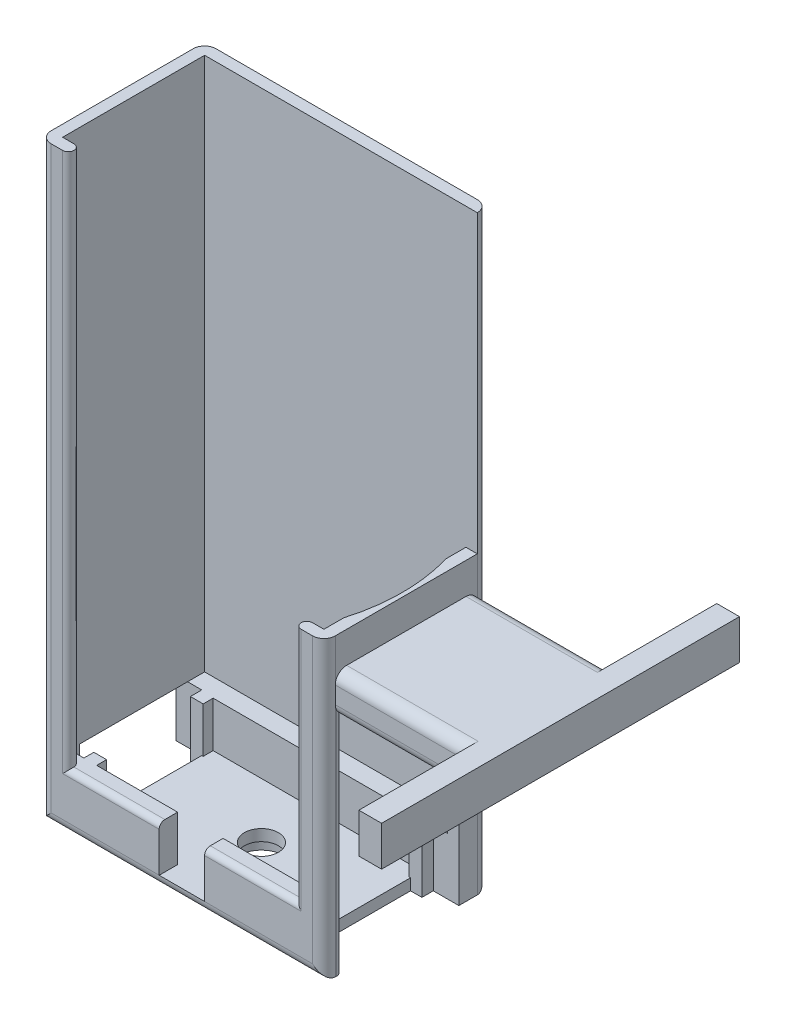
ISO-10303-21;
HEADER;
FILE_DESCRIPTION(('STEP AP214'),'2;1');
FILE_NAME('part.step','',(''),(''),'','','');
FILE_SCHEMA(('AUTOMOTIVE_DESIGN { 1 0 10303 214 1 1 1 1 }'));
ENDSEC;
DATA;
#1=APPLICATION_CONTEXT('core data for automotive mechanical design processes');
#2=APPLICATION_PROTOCOL_DEFINITION('international standard','automotive_design',2000,#1);
#3=PRODUCT_CONTEXT('',#1,'mechanical');
#4=PRODUCT('Part','Part','',(#3));
#5=PRODUCT_RELATED_PRODUCT_CATEGORY('part','',(#4));
#6=PRODUCT_DEFINITION_FORMATION('','',#4);
#7=PRODUCT_DEFINITION_CONTEXT('part definition',#1,'design');
#8=PRODUCT_DEFINITION('design','',#6,#7);
#9=PRODUCT_DEFINITION_SHAPE('','',#8);
#10=(LENGTH_UNIT() NAMED_UNIT(*) SI_UNIT(.MILLI.,.METRE.));
#11=(NAMED_UNIT(*) PLANE_ANGLE_UNIT() SI_UNIT($,.RADIAN.));
#12=(NAMED_UNIT(*) SI_UNIT($,.STERADIAN.) SOLID_ANGLE_UNIT());
#13=UNCERTAINTY_MEASURE_WITH_UNIT(LENGTH_MEASURE(1.E-05),#10,'distance_accuracy_value','');
#14=(GEOMETRIC_REPRESENTATION_CONTEXT(3) GLOBAL_UNCERTAINTY_ASSIGNED_CONTEXT((#13)) GLOBAL_UNIT_ASSIGNED_CONTEXT((#10,
#11,#12)) REPRESENTATION_CONTEXT('',''));
#15=CARTESIAN_POINT('',(0.,0.,0.));
#16=DIRECTION('',(0.,0.,1.));
#17=DIRECTION('',(1.,0.,0.));
#18=AXIS2_PLACEMENT_3D('',#15,#16,#17);
#19=CARTESIAN_POINT('',(-44.2838709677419,2.,27.7096774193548));
#20=DIRECTION('',(0.,-1.,0.));
#21=DIRECTION('',(0.,0.,-1.));
#22=AXIS2_PLACEMENT_3D('',#19,#20,#21);
#23=PLANE('',#22);
#24=CARTESIAN_POINT('',(-19.2838709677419,2.,13.7096774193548));
#25=DIRECTION('',(0.,-1.,0.));
#26=DIRECTION('',(0.,0.,-1.));
#27=AXIS2_PLACEMENT_3D('',#24,#25,#26);
#28=CIRCLE('',#27,3.);
#29=CARTESIAN_POINT('',(-19.2838709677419,2.,10.7096774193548));
#30=VERTEX_POINT('',#29);
#31=EDGE_CURVE('E777',#30,#30,#28,.T.);
#32=ORIENTED_EDGE('',*,*,#31,.T.);
#33=EDGE_LOOP('',(#32));
#34=FACE_BOUND('',#33,.T.);
#35=DIRECTION('',(-1.,0.,0.));
#36=VECTOR('',#35,1.);
#37=CARTESIAN_POINT('',(1.21612903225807,2.,22.4596774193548));
#38=LINE('',#37,#36);
#39=CARTESIAN_POINT('',(-0.783870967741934,2.,22.4596774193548));
#40=VERTEX_POINT('',#39);
#41=CARTESIAN_POINT('',(-1.03387096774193,2.,22.4596774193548));
#42=VERTEX_POINT('',#41);
#43=EDGE_CURVE('E524',#40,#42,#38,.T.);
#44=ORIENTED_EDGE('',*,*,#43,.F.);
#45=DIRECTION('',(0.,0.,-1.));
#46=VECTOR('',#45,1.);
#47=CARTESIAN_POINT('',(-0.783870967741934,2.,27.7096774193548));
#48=LINE('',#47,#46);
#49=CARTESIAN_POINT('',(-0.783870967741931,2.,5.95967741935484));
#50=VERTEX_POINT('',#49);
#51=EDGE_CURVE('E743',#40,#50,#48,.T.);
#52=ORIENTED_EDGE('',*,*,#51,.T.);
#53=DIRECTION('',(1.,0.,0.));
#54=VECTOR('',#53,1.);
#55=CARTESIAN_POINT('',(1.21612903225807,2.,5.95967741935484));
#56=LINE('',#55,#54);
#57=CARTESIAN_POINT('',(-1.03387096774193,2.,5.95967741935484));
#58=VERTEX_POINT('',#57);
#59=EDGE_CURVE('E538',#58,#50,#56,.T.);
#60=ORIENTED_EDGE('',*,*,#59,.F.);
#61=DIRECTION('',(0.,0.,1.));
#62=VECTOR('',#61,1.);
#63=CARTESIAN_POINT('',(-1.03387096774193,2.,3.95967741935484));
#64=LINE('',#63,#62);
#65=CARTESIAN_POINT('',(-1.03387096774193,2.,3.95967741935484));
#66=VERTEX_POINT('',#65);
#67=EDGE_CURVE('E540',#66,#58,#64,.T.);
#68=ORIENTED_EDGE('',*,*,#67,.F.);
#69=DIRECTION('',(1.,0.,0.));
#70=VECTOR('',#69,1.);
#71=CARTESIAN_POINT('',(-44.2838709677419,2.,3.95967741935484));
#72=LINE('',#71,#70);
#73=CARTESIAN_POINT('',(-37.5338709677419,2.,3.95967741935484));
#74=VERTEX_POINT('',#73);
#75=EDGE_CURVE('E811',#74,#66,#72,.T.);
#76=ORIENTED_EDGE('',*,*,#75,.F.);
#77=DIRECTION('',(0.,0.,-1.));
#78=VECTOR('',#77,1.);
#79=CARTESIAN_POINT('',(-37.5338709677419,2.,3.70967741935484));
#80=LINE('',#79,#78);
#81=CARTESIAN_POINT('',(-37.5338709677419,2.,5.70967741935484));
#82=VERTEX_POINT('',#81);
#83=EDGE_CURVE('E577',#82,#74,#80,.T.);
#84=ORIENTED_EDGE('',*,*,#83,.F.);
#85=DIRECTION('',(1.,0.,0.));
#86=VECTOR('',#85,1.);
#87=CARTESIAN_POINT('',(-39.7838709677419,2.,5.70967741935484));
#88=LINE('',#87,#86);
#89=CARTESIAN_POINT('',(-37.7838709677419,2.,5.70967741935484));
#90=VERTEX_POINT('',#89);
#91=EDGE_CURVE('E567',#90,#82,#88,.T.);
#92=ORIENTED_EDGE('',*,*,#91,.F.);
#93=DIRECTION('',(0.,0.,1.));
#94=VECTOR('',#93,1.);
#95=CARTESIAN_POINT('',(-37.7838709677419,2.,27.7096774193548));
#96=LINE('',#95,#94);
#97=CARTESIAN_POINT('',(-37.7838709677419,2.,22.7096774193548));
#98=VERTEX_POINT('',#97);
#99=EDGE_CURVE('E772',#90,#98,#96,.T.);
#100=ORIENTED_EDGE('',*,*,#99,.T.);
#101=DIRECTION('',(-1.,0.,0.));
#102=VECTOR('',#101,1.);
#103=CARTESIAN_POINT('',(-39.7838709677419,2.,22.7096774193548));
#104=LINE('',#103,#102);
#105=CARTESIAN_POINT('',(-37.5338709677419,2.,22.7096774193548));
#106=VERTEX_POINT('',#105);
#107=EDGE_CURVE('E60',#106,#98,#104,.T.);
#108=ORIENTED_EDGE('',*,*,#107,.F.);
#109=DIRECTION('',(0.,0.,-1.));
#110=VECTOR('',#109,1.);
#111=CARTESIAN_POINT('',(-37.5338709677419,2.,22.7096774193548));
#112=LINE('',#111,#110);
#113=CARTESIAN_POINT('',(-37.5338709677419,2.,24.4596774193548));
#114=VERTEX_POINT('',#113);
#115=EDGE_CURVE('E561',#114,#106,#112,.T.);
#116=ORIENTED_EDGE('',*,*,#115,.F.);
#117=DIRECTION('',(-1.,0.,0.));
#118=VECTOR('',#117,1.);
#119=CARTESIAN_POINT('',(5.71612903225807,2.,24.4596774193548));
#120=LINE('',#119,#118);
#121=CARTESIAN_POINT('',(-23.2838709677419,2.,24.4596774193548));
#122=VERTEX_POINT('',#121);
#123=EDGE_CURVE('E830',#122,#114,#120,.T.);
#124=ORIENTED_EDGE('',*,*,#123,.F.);
#125=DIRECTION('',(0.,0.,1.));
#126=VECTOR('',#125,1.);
#127=CARTESIAN_POINT('',(-23.2838709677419,2.,22.7096774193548));
#128=LINE('',#127,#126);
#129=CARTESIAN_POINT('',(-23.2838709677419,2.,27.7096774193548));
#130=VERTEX_POINT('',#129);
#131=EDGE_CURVE('E701',#122,#130,#128,.T.);
#132=ORIENTED_EDGE('',*,*,#131,.T.);
#133=DIRECTION('',(1.,0.,0.));
#134=VECTOR('',#133,1.);
#135=CARTESIAN_POINT('',(-23.2838709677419,2.,27.7096774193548));
#136=LINE('',#135,#134);
#137=CARTESIAN_POINT('',(-15.2838709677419,2.,27.7096774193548));
#138=VERTEX_POINT('',#137);
#139=EDGE_CURVE('E696',#130,#138,#136,.T.);
#140=ORIENTED_EDGE('',*,*,#139,.T.);
#141=DIRECTION('',(0.,0.,1.));
#142=VECTOR('',#141,1.);
#143=CARTESIAN_POINT('',(-15.2838709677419,2.,22.7096774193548));
#144=LINE('',#143,#142);
#145=CARTESIAN_POINT('',(-15.2838709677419,2.,24.4596774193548));
#146=VERTEX_POINT('',#145);
#147=EDGE_CURVE('E708',#146,#138,#144,.T.);
#148=ORIENTED_EDGE('',*,*,#147,.F.);
#149=CARTESIAN_POINT('',(-1.03387096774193,2.,24.4596774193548));
#150=VERTEX_POINT('',#149);
#151=EDGE_CURVE('E827',#150,#146,#120,.T.);
#152=ORIENTED_EDGE('',*,*,#151,.F.);
#153=DIRECTION('',(0.,0.,1.));
#154=VECTOR('',#153,1.);
#155=CARTESIAN_POINT('',(-1.03387096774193,2.,22.4596774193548));
#156=LINE('',#155,#154);
#157=EDGE_CURVE('E522',#42,#150,#156,.T.);
#158=ORIENTED_EDGE('',*,*,#157,.F.);
#159=EDGE_LOOP('',(#44,#52,#60,#68,#76,#84,#92,#100,#108,#116,#124,#132,#140,#148,#152,#158));
#160=FACE_BOUND('',#159,.T.);
#161=ADVANCED_FACE('F43',(#34,#160),#23,.F.);
#162=CARTESIAN_POINT('',(5.71612903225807,10.,24.4596774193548));
#163=DIRECTION('',(0.,0.,1.));
#164=DIRECTION('',(1.,0.,0.));
#165=AXIS2_PLACEMENT_3D('',#162,#163,#164);
#166=PLANE('',#165);
#167=DIRECTION('',(0.,-1.,0.));
#168=VECTOR('',#167,1.);
#169=CARTESIAN_POINT('',(1.21612903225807,2.,24.4596774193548));
#170=LINE('',#169,#168);
#171=CARTESIAN_POINT('',(1.21612903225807,10.,24.4596774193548));
#172=VERTEX_POINT('',#171);
#173=CARTESIAN_POINT('',(1.21612903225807,0.,24.4596774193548));
#174=VERTEX_POINT('',#173);
#175=EDGE_CURVE('E603',#172,#174,#170,.T.);
#176=ORIENTED_EDGE('',*,*,#175,.F.);
#177=DIRECTION('',(-1.,0.,0.));
#178=VECTOR('',#177,1.);
#179=CARTESIAN_POINT('',(5.71612903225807,10.,24.4596774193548));
#180=LINE('',#179,#178);
#181=CARTESIAN_POINT('',(3.71612903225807,10.,24.4596774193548));
#182=VERTEX_POINT('',#181);
#183=EDGE_CURVE('E821',#182,#172,#180,.T.);
#184=ORIENTED_EDGE('',*,*,#183,.F.);
#185=DIRECTION('',(0.,-1.,0.));
#186=VECTOR('',#185,1.);
#187=CARTESIAN_POINT('',(3.71612903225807,52.,24.4596774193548));
#188=LINE('',#187,#186);
#189=CARTESIAN_POINT('',(3.71612903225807,39.6459503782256,24.4596774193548));
#190=VERTEX_POINT('',#189);
#191=EDGE_CURVE('E850',#190,#182,#188,.T.);
#192=ORIENTED_EDGE('',*,*,#191,.F.);
#193=DIRECTION('',(-1.,0.,0.));
#194=VECTOR('',#193,1.);
#195=CARTESIAN_POINT('',(3.71612903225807,39.6459503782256,24.4596774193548));
#196=LINE('',#195,#194);
#197=CARTESIAN_POINT('',(4.71612903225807,39.6459503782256,24.4596774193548));
#198=VERTEX_POINT('',#197);
#199=EDGE_CURVE('E959',#190,#198,#196,.F.);
#200=ORIENTED_EDGE('',*,*,#199,.T.);
#201=DIRECTION('',(0.,-1.,0.));
#202=VECTOR('',#201,1.);
#203=CARTESIAN_POINT('',(4.71612903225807,10.,24.4596774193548));
#204=LINE('',#203,#202);
#205=CARTESIAN_POINT('',(4.71612903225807,0.,24.4596774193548));
#206=VERTEX_POINT('',#205);
#207=EDGE_CURVE('E903',#198,#206,#204,.T.);
#208=ORIENTED_EDGE('',*,*,#207,.T.);
#209=DIRECTION('',(-1.,0.,0.));
#210=VECTOR('',#209,1.);
#211=CARTESIAN_POINT('',(5.71612903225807,0.,24.4596774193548));
#212=LINE('',#211,#210);
#213=EDGE_CURVE('E730',#206,#174,#212,.T.);
#214=ORIENTED_EDGE('',*,*,#213,.T.);
#215=EDGE_LOOP('',(#176,#184,#192,#200,#208,#214));
#216=FACE_BOUND('',#215,.T.);
#217=ADVANCED_FACE('F1057',(#216),#166,.F.);
#218=DIRECTION('',(0.,-1.,0.));
#219=VECTOR('',#218,1.);
#220=CARTESIAN_POINT('',(-1.03387096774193,10.,24.4596774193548));
#221=LINE('',#220,#219);
#222=CARTESIAN_POINT('',(-1.03387096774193,10.,24.4596774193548));
#223=VERTEX_POINT('',#222);
#224=EDGE_CURVE('E518',#223,#150,#221,.T.);
#225=ORIENTED_EDGE('',*,*,#224,.T.);
#226=ORIENTED_EDGE('',*,*,#151,.T.);
#227=DIRECTION('',(0.,1.,0.));
#228=VECTOR('',#227,1.);
#229=CARTESIAN_POINT('',(-15.2838709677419,10.,24.4596774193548));
#230=LINE('',#229,#228);
#231=CARTESIAN_POINT('',(-15.2838709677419,10.,24.4596774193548));
#232=VERTEX_POINT('',#231);
#233=EDGE_CURVE('E704',#146,#232,#230,.T.);
#234=ORIENTED_EDGE('',*,*,#233,.T.);
#235=EDGE_CURVE('E825',#223,#232,#180,.T.);
#236=ORIENTED_EDGE('',*,*,#235,.F.);
#237=EDGE_LOOP('',(#225,#226,#234,#236));
#238=FACE_BOUND('',#237,.T.);
#239=ADVANCED_FACE('F1060',(#238),#166,.F.);
#240=CARTESIAN_POINT('',(-44.2838709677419,10.,3.95967741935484));
#241=DIRECTION('',(0.,0.,-1.));
#242=DIRECTION('',(-1.,0.,0.));
#243=AXIS2_PLACEMENT_3D('',#240,#241,#242);
#244=PLANE('',#243);
#245=DIRECTION('',(1.,0.,0.));
#246=VECTOR('',#245,1.);
#247=CARTESIAN_POINT('',(-44.2838709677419,10.,3.95967741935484));
#248=LINE('',#247,#246);
#249=CARTESIAN_POINT('',(1.21612903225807,10.,3.95967741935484));
#250=VERTEX_POINT('',#249);
#251=CARTESIAN_POINT('',(3.71612903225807,10.,3.95967741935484));
#252=VERTEX_POINT('',#251);
#253=EDGE_CURVE('E818',#250,#252,#248,.T.);
#254=ORIENTED_EDGE('',*,*,#253,.F.);
#255=DIRECTION('',(0.,1.,0.));
#256=VECTOR('',#255,1.);
#257=CARTESIAN_POINT('',(1.21612903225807,0.,3.95967741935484));
#258=LINE('',#257,#256);
#259=CARTESIAN_POINT('',(1.21612903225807,0.,3.95967741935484));
#260=VERTEX_POINT('',#259);
#261=EDGE_CURVE('E597',#260,#250,#258,.T.);
#262=ORIENTED_EDGE('',*,*,#261,.F.);
#263=DIRECTION('',(1.,0.,0.));
#264=VECTOR('',#263,1.);
#265=CARTESIAN_POINT('',(5.71612903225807,0.,3.95967741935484));
#266=LINE('',#265,#264);
#267=CARTESIAN_POINT('',(5.71612903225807,0.,3.95967741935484));
#268=VERTEX_POINT('',#267);
#269=EDGE_CURVE('E735',#260,#268,#266,.T.);
#270=ORIENTED_EDGE('',*,*,#269,.T.);
#271=DIRECTION('',(0.,-1.,0.));
#272=VECTOR('',#271,1.);
#273=CARTESIAN_POINT('',(5.71612903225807,39.5,3.95967741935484));
#274=LINE('',#273,#272);
#275=CARTESIAN_POINT('',(5.71612903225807,39.5,3.95967741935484));
#276=VERTEX_POINT('',#275);
#277=EDGE_CURVE('E734',#276,#268,#274,.T.);
#278=ORIENTED_EDGE('',*,*,#277,.F.);
#279=DIRECTION('',(1.,0.,0.));
#280=VECTOR('',#279,1.);
#281=CARTESIAN_POINT('',(5.71612903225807,39.5,3.95967741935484));
#282=LINE('',#281,#280);
#283=CARTESIAN_POINT('',(3.71612903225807,39.5,3.95967741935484));
#284=VERTEX_POINT('',#283);
#285=EDGE_CURVE('E731',#284,#276,#282,.T.);
#286=ORIENTED_EDGE('',*,*,#285,.F.);
#287=DIRECTION('',(0.,1.,0.));
#288=VECTOR('',#287,1.);
#289=CARTESIAN_POINT('',(3.71612903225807,52.,3.95967741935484));
#290=LINE('',#289,#288);
#291=EDGE_CURVE('E853',#252,#284,#290,.T.);
#292=ORIENTED_EDGE('',*,*,#291,.F.);
#293=EDGE_LOOP('',(#254,#262,#270,#278,#286,#292));
#294=FACE_BOUND('',#293,.T.);
#295=ADVANCED_FACE('F1072',(#294),#244,.F.);
#296=DIRECTION('',(0.,-1.,0.));
#297=VECTOR('',#296,1.);
#298=CARTESIAN_POINT('',(-1.03387096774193,10.,3.95967741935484));
#299=LINE('',#298,#297);
#300=CARTESIAN_POINT('',(-1.03387096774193,10.,3.95967741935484));
#301=VERTEX_POINT('',#300);
#302=EDGE_CURVE('E527',#301,#66,#299,.T.);
#303=ORIENTED_EDGE('',*,*,#302,.F.);
#304=CARTESIAN_POINT('',(-37.5338709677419,10.,3.95967741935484));
#305=VERTEX_POINT('',#304);
#306=EDGE_CURVE('E815',#305,#301,#248,.T.);
#307=ORIENTED_EDGE('',*,*,#306,.F.);
#308=DIRECTION('',(0.,1.,0.));
#309=VECTOR('',#308,1.);
#310=CARTESIAN_POINT('',(-37.5338709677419,10.,3.95967741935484));
#311=LINE('',#310,#309);
#312=EDGE_CURVE('E587',#74,#305,#311,.T.);
#313=ORIENTED_EDGE('',*,*,#312,.F.);
#314=ORIENTED_EDGE('',*,*,#75,.T.);
#315=EDGE_LOOP('',(#303,#307,#313,#314));
#316=FACE_BOUND('',#315,.T.);
#317=ADVANCED_FACE('F1050',(#316),#244,.F.);
#318=DIRECTION('',(0.,0.,1.));
#319=VECTOR('',#318,1.);
#320=CARTESIAN_POINT('',(-39.7838709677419,2.,22.7096774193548));
#321=LINE('',#320,#319);
#322=CARTESIAN_POINT('',(-39.7838709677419,2.,22.7096774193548));
#323=VERTEX_POINT('',#322);
#324=CARTESIAN_POINT('',(-39.7838709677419,2.,24.4596774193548));
#325=VERTEX_POINT('',#324);
#326=EDGE_CURVE('E564',#323,#325,#321,.T.);
#327=ORIENTED_EDGE('',*,*,#326,.F.);
#328=DIRECTION('',(-1.,0.,0.));
#329=VECTOR('',#328,1.);
#330=CARTESIAN_POINT('',(-44.2838709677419,2.,22.7096774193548));
#331=LINE('',#330,#329);
#332=CARTESIAN_POINT('',(-42.2838709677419,2.,22.7096774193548));
#333=VERTEX_POINT('',#332);
#334=EDGE_CURVE('E765',#323,#333,#331,.T.);
#335=ORIENTED_EDGE('',*,*,#334,.T.);
#336=DIRECTION('',(0.,0.,-1.));
#337=VECTOR('',#336,1.);
#338=CARTESIAN_POINT('',(-42.2838709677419,2.,27.7096774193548));
#339=LINE('',#338,#337);
#340=CARTESIAN_POINT('',(-42.2838709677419,2.,24.4596774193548));
#341=VERTEX_POINT('',#340);
#342=EDGE_CURVE('E799',#341,#333,#339,.T.);
#343=ORIENTED_EDGE('',*,*,#342,.F.);
#344=EDGE_CURVE('E814',#325,#341,#120,.T.);
#345=ORIENTED_EDGE('',*,*,#344,.F.);
#346=EDGE_LOOP('',(#327,#335,#343,#345));
#347=FACE_BOUND('',#346,.T.);
#348=ADVANCED_FACE('F1046',(#347),#23,.F.);
#349=DIRECTION('',(0.,-1.,0.));
#350=VECTOR('',#349,1.);
#351=CARTESIAN_POINT('',(-39.7838709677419,10.,24.4596774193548));
#352=LINE('',#351,#350);
#353=CARTESIAN_POINT('',(-39.7838709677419,10.,24.4596774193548));
#354=VERTEX_POINT('',#353);
#355=EDGE_CURVE('E68',#354,#325,#352,.T.);
#356=ORIENTED_EDGE('',*,*,#355,.T.);
#357=ORIENTED_EDGE('',*,*,#344,.T.);
#358=DIRECTION('',(0.,-1.,0.));
#359=VECTOR('',#358,1.);
#360=CARTESIAN_POINT('',(-42.2838709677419,10.,24.4596774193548));
#361=LINE('',#360,#359);
#362=CARTESIAN_POINT('',(-42.2838709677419,10.,24.4596774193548));
#363=VERTEX_POINT('',#362);
#364=EDGE_CURVE('E807',#363,#341,#361,.T.);
#365=ORIENTED_EDGE('',*,*,#364,.F.);
#366=EDGE_CURVE('E829',#354,#363,#180,.T.);
#367=ORIENTED_EDGE('',*,*,#366,.F.);
#368=EDGE_LOOP('',(#356,#357,#365,#367));
#369=FACE_BOUND('',#368,.T.);
#370=ADVANCED_FACE('F1049',(#369),#166,.F.);
#371=DIRECTION('',(0.,-1.,0.));
#372=VECTOR('',#371,1.);
#373=CARTESIAN_POINT('',(-37.5338709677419,10.,24.4596774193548));
#374=LINE('',#373,#372);
#375=CARTESIAN_POINT('',(-37.5338709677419,10.,24.4596774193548));
#376=VERTEX_POINT('',#375);
#377=EDGE_CURVE('E550',#376,#114,#374,.T.);
#378=ORIENTED_EDGE('',*,*,#377,.F.);
#379=CARTESIAN_POINT('',(-23.2838709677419,10.,24.4596774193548));
#380=VERTEX_POINT('',#379);
#381=EDGE_CURVE('E826',#380,#376,#180,.T.);
#382=ORIENTED_EDGE('',*,*,#381,.F.);
#383=DIRECTION('',(0.,-1.,0.));
#384=VECTOR('',#383,1.);
#385=CARTESIAN_POINT('',(-23.2838709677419,10.,24.4596774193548));
#386=LINE('',#385,#384);
#387=EDGE_CURVE('E713',#380,#122,#386,.T.);
#388=ORIENTED_EDGE('',*,*,#387,.T.);
#389=ORIENTED_EDGE('',*,*,#123,.T.);
#390=EDGE_LOOP('',(#378,#382,#388,#389));
#391=FACE_BOUND('',#390,.T.);
#392=ADVANCED_FACE('F1062',(#391),#166,.F.);
#393=CARTESIAN_POINT('',(-44.2838709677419,10.,3.70967741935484));
#394=DIRECTION('',(0.,0.,-1.));
#395=DIRECTION('',(-1.,0.,0.));
#396=AXIS2_PLACEMENT_3D('',#393,#394,#395);
#397=PLANE('',#396);
#398=DIRECTION('',(0.,-1.,0.));
#399=VECTOR('',#398,1.);
#400=CARTESIAN_POINT('',(-39.7838709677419,0.,3.70967741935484));
#401=LINE('',#400,#399);
#402=CARTESIAN_POINT('',(-39.7838709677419,10.,3.70967741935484));
#403=VERTEX_POINT('',#402);
#404=CARTESIAN_POINT('',(-39.7838709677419,0.,3.70967741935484));
#405=VERTEX_POINT('',#404);
#406=EDGE_CURVE('E615',#403,#405,#401,.T.);
#407=ORIENTED_EDGE('',*,*,#406,.F.);
#408=DIRECTION('',(1.,0.,0.));
#409=VECTOR('',#408,1.);
#410=CARTESIAN_POINT('',(-44.2838709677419,10.,3.70967741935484));
#411=LINE('',#410,#409);
#412=CARTESIAN_POINT('',(-42.2838709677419,10.,3.70967741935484));
#413=VERTEX_POINT('',#412);
#414=EDGE_CURVE('E750',#413,#403,#411,.T.);
#415=ORIENTED_EDGE('',*,*,#414,.F.);
#416=CARTESIAN_POINT('',(-44.2838709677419,10.,3.70967741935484));
#417=VERTEX_POINT('',#416);
#418=EDGE_CURVE('E752',#417,#413,#411,.T.);
#419=ORIENTED_EDGE('',*,*,#418,.F.);
#420=DIRECTION('',(0.,-1.,0.));
#421=VECTOR('',#420,1.);
#422=CARTESIAN_POINT('',(-44.2838709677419,10.,3.70967741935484));
#423=LINE('',#422,#421);
#424=CARTESIAN_POINT('',(-44.2838709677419,0.,3.70967741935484));
#425=VERTEX_POINT('',#424);
#426=EDGE_CURVE('E757',#417,#425,#423,.T.);
#427=ORIENTED_EDGE('',*,*,#426,.T.);
#428=DIRECTION('',(1.,0.,0.));
#429=VECTOR('',#428,1.);
#430=CARTESIAN_POINT('',(-44.2838709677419,0.,3.70967741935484));
#431=LINE('',#430,#429);
#432=EDGE_CURVE('E746',#425,#405,#431,.T.);
#433=ORIENTED_EDGE('',*,*,#432,.T.);
#434=EDGE_LOOP('',(#407,#415,#419,#427,#433));
#435=FACE_BOUND('',#434,.T.);
#436=ADVANCED_FACE('F1091',(#435),#397,.F.);
#437=CARTESIAN_POINT('',(-0.783870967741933,39.5,24.4596774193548));
#438=DIRECTION('',(-1.,0.,0.));
#439=DIRECTION('',(0.,0.,1.));
#440=AXIS2_PLACEMENT_3D('',#437,#438,#439);
#441=PLANE('',#440);
#442=DIRECTION('',(0.,-1.,0.));
#443=VECTOR('',#442,1.);
#444=CARTESIAN_POINT('',(-0.783870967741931,0.,5.95967741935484));
#445=LINE('',#444,#443);
#446=CARTESIAN_POINT('',(-0.783870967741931,0.,5.95967741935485));
#447=VERTEX_POINT('',#446);
#448=EDGE_CURVE('E593',#50,#447,#445,.T.);
#449=ORIENTED_EDGE('',*,*,#448,.F.);
#450=ORIENTED_EDGE('',*,*,#51,.F.);
#451=DIRECTION('',(0.,1.,0.));
#452=VECTOR('',#451,1.);
#453=CARTESIAN_POINT('',(-0.783870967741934,2.,22.4596774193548));
#454=LINE('',#453,#452);
#455=CARTESIAN_POINT('',(-0.783870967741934,0.,22.4596774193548));
#456=VERTEX_POINT('',#455);
#457=EDGE_CURVE('E596',#456,#40,#454,.T.);
#458=ORIENTED_EDGE('',*,*,#457,.F.);
#459=DIRECTION('',(0.,0.,-1.));
#460=VECTOR('',#459,1.);
#461=CARTESIAN_POINT('',(-0.783870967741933,0.,24.4596774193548));
#462=LINE('',#461,#460);
#463=EDGE_CURVE('E738',#456,#447,#462,.T.);
#464=ORIENTED_EDGE('',*,*,#463,.T.);
#465=EDGE_LOOP('',(#449,#450,#458,#464));
#466=FACE_BOUND('',#465,.T.);
#467=ADVANCED_FACE('F1094',(#466),#441,.F.);
#468=CARTESIAN_POINT('',(-37.7838709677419,10.,22.7096774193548));
#469=DIRECTION('',(1.,0.,0.));
#470=DIRECTION('',(0.,0.,-1.));
#471=AXIS2_PLACEMENT_3D('',#468,#469,#470);
#472=PLANE('',#471);
#473=DIRECTION('',(0.,1.,0.));
#474=VECTOR('',#473,1.);
#475=CARTESIAN_POINT('',(-37.7838709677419,0.,5.70967741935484));
#476=LINE('',#475,#474);
#477=CARTESIAN_POINT('',(-37.7838709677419,0.,5.70967741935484));
#478=VERTEX_POINT('',#477);
#479=EDGE_CURVE('E614',#478,#90,#476,.T.);
#480=ORIENTED_EDGE('',*,*,#479,.F.);
#481=DIRECTION('',(0.,0.,1.));
#482=VECTOR('',#481,1.);
#483=CARTESIAN_POINT('',(-37.7838709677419,0.,22.7096774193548));
#484=LINE('',#483,#482);
#485=CARTESIAN_POINT('',(-37.7838709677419,0.,22.7096774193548));
#486=VERTEX_POINT('',#485);
#487=EDGE_CURVE('E759',#478,#486,#484,.T.);
#488=ORIENTED_EDGE('',*,*,#487,.T.);
#489=DIRECTION('',(0.,-1.,0.));
#490=VECTOR('',#489,1.);
#491=CARTESIAN_POINT('',(-37.7838709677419,10.,22.7096774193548));
#492=LINE('',#491,#490);
#493=EDGE_CURVE('E766',#98,#486,#492,.T.);
#494=ORIENTED_EDGE('',*,*,#493,.F.);
#495=ORIENTED_EDGE('',*,*,#99,.F.);
#496=EDGE_LOOP('',(#480,#488,#494,#495));
#497=FACE_BOUND('',#496,.T.);
#498=ADVANCED_FACE('F1096',(#497),#472,.F.);
#499=CARTESIAN_POINT('',(3.71612903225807,52.,27.7096774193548));
#500=DIRECTION('',(1.,0.,0.));
#501=DIRECTION('',(0.,0.,-1.));
#502=AXIS2_PLACEMENT_3D('',#499,#500,#501);
#503=PLANE('',#502);
#504=DIRECTION('',(0.,0.,1.));
#505=VECTOR('',#504,1.);
#506=CARTESIAN_POINT('',(3.71612903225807,39.5,27.7096774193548));
#507=LINE('',#506,#505);
#508=CARTESIAN_POINT('',(3.71612903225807,39.5,4.20967741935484));
#509=VERTEX_POINT('',#508);
#510=EDGE_CURVE('E847',#284,#509,#507,.T.);
#511=ORIENTED_EDGE('',*,*,#510,.T.);
#512=DIRECTION('',(0.,1.,0.));
#513=VECTOR('',#512,1.);
#514=CARTESIAN_POINT('',(3.71612903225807,30.,4.20967741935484));
#515=LINE('',#514,#513);
#516=CARTESIAN_POINT('',(3.71612903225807,52.,4.20967741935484));
#517=VERTEX_POINT('',#516);
#518=EDGE_CURVE('E629',#509,#517,#515,.T.);
#519=ORIENTED_EDGE('',*,*,#518,.T.);
#520=DIRECTION('',(0.,0.,1.));
#521=VECTOR('',#520,1.);
#522=CARTESIAN_POINT('',(3.71612903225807,52.,27.7096774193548));
#523=LINE('',#522,#521);
#524=CARTESIAN_POINT('',(3.71612903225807,52.,0.709677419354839));
#525=VERTEX_POINT('',#524);
#526=EDGE_CURVE('E784',#525,#517,#523,.T.);
#527=ORIENTED_EDGE('',*,*,#526,.F.);
#528=DIRECTION('',(0.,-1.,0.));
#529=VECTOR('',#528,1.);
#530=CARTESIAN_POINT('',(3.71612903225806,64.,0.709677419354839));
#531=LINE('',#530,#529);
#532=CARTESIAN_POINT('',(3.71612903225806,10.,0.709677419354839));
#533=VERTEX_POINT('',#532);
#534=EDGE_CURVE('E791',#525,#533,#531,.T.);
#535=ORIENTED_EDGE('',*,*,#534,.T.);
#536=DIRECTION('',(0.,0.,-1.));
#537=VECTOR('',#536,1.);
#538=CARTESIAN_POINT('',(3.71612903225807,10.,0.));
#539=LINE('',#538,#537);
#540=EDGE_CURVE('E789',#252,#533,#539,.T.);
#541=ORIENTED_EDGE('',*,*,#540,.F.);
#542=ORIENTED_EDGE('',*,*,#291,.T.);
#543=EDGE_LOOP('',(#511,#519,#527,#535,#541,#542));
#544=FACE_BOUND('',#543,.T.);
#545=ADVANCED_FACE('F1082',(#544),#503,.F.);
#546=CARTESIAN_POINT('',(0.,0.,0.));
#547=DIRECTION('',(0.,1.,0.));
#548=DIRECTION('',(0.,0.,1.));
#549=AXIS2_PLACEMENT_3D('',#546,#547,#548);
#550=PLANE('',#549);
#551=CARTESIAN_POINT('',(-19.2838709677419,0.,13.7096774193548));
#552=DIRECTION('',(0.,-1.,0.));
#553=DIRECTION('',(0.,0.,-1.));
#554=AXIS2_PLACEMENT_3D('',#551,#552,#553);
#555=CIRCLE('',#554,3.);
#556=CARTESIAN_POINT('',(-19.2838709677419,0.,10.7096774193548));
#557=VERTEX_POINT('',#556);
#558=EDGE_CURVE('E774',#557,#557,#555,.T.);
#559=ORIENTED_EDGE('',*,*,#558,.F.);
#560=EDGE_LOOP('',(#559));
#561=FACE_BOUND('',#560,.T.);
#562=CARTESIAN_POINT('',(-19.2838709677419,0.,13.7096774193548));
#563=DIRECTION('',(0.,-1.,0.));
#564=DIRECTION('',(0.,0.,-1.));
#565=AXIS2_PLACEMENT_3D('',#562,#563,#564);
#566=CIRCLE('',#565,4.);
#567=CARTESIAN_POINT('',(-19.2838709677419,0.,9.70967741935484));
#568=VERTEX_POINT('',#567);
#569=EDGE_CURVE('E632',#568,#568,#566,.T.);
#570=ORIENTED_EDGE('',*,*,#569,.T.);
#571=EDGE_LOOP('',(#570));
#572=FACE_BOUND('',#571,.T.);
#573=ADVANCED_FACE('F1036',(#561,#572),#550,.F.);
#574=CARTESIAN_POINT('',(5.71612903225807,64.,-1.29032258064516));
#575=DIRECTION('',(-1.,0.,0.));
#576=DIRECTION('',(0.,0.,1.));
#577=AXIS2_PLACEMENT_3D('',#574,#575,#576);
#578=PLANE('',#577);
#579=DIRECTION('',(0.,-1.,0.));
#580=VECTOR('',#579,1.);
#581=CARTESIAN_POINT('',(5.71612903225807,64.,25.4596774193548));
#582=LINE('',#581,#580);
#583=CARTESIAN_POINT('',(5.71612903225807,0.,25.4596774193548));
#584=VERTEX_POINT('',#583);
#585=CARTESIAN_POINT('',(5.71612903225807,40.5317541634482,25.4596774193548));
#586=VERTEX_POINT('',#585);
#587=EDGE_CURVE('E908',#584,#586,#582,.F.);
#588=ORIENTED_EDGE('',*,*,#587,.T.);
#589=CARTESIAN_POINT('',(5.71612903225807,41.5,23.7096774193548));
#590=DIRECTION('',(-1.,0.,0.));
#591=DIRECTION('',(0.,0.,1.));
#592=AXIS2_PLACEMENT_3D('',#589,#590,#591);
#593=CIRCLE('',#592,2.);
#594=CARTESIAN_POINT('',(5.71612903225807,41.5,25.7096774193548));
#595=VERTEX_POINT('',#594);
#596=EDGE_CURVE('E971',#586,#595,#593,.T.);
#597=ORIENTED_EDGE('',*,*,#596,.T.);
#598=DIRECTION('',(0.,1.,0.));
#599=VECTOR('',#598,1.);
#600=CARTESIAN_POINT('',(5.71612903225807,64.,25.7096774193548));
#601=LINE('',#600,#599);
#602=CARTESIAN_POINT('',(5.71612903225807,0.,25.7096774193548));
#603=VERTEX_POINT('',#602);
#604=EDGE_CURVE('E870',#595,#603,#601,.F.);
#605=ORIENTED_EDGE('',*,*,#604,.T.);
#606=DIRECTION('',(0.,0.,-1.));
#607=VECTOR('',#606,1.);
#608=CARTESIAN_POINT('',(5.71612903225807,0.,-1.29032258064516));
#609=LINE('',#608,#607);
#610=EDGE_CURVE('E834',#603,#584,#609,.T.);
#611=ORIENTED_EDGE('',*,*,#610,.T.);
#612=EDGE_LOOP('',(#588,#597,#605,#611));
#613=FACE_BOUND('',#612,.T.);
#614=ADVANCED_FACE('F1032',(#613),#578,.F.);
#615=DIRECTION('',(0.,0.,-1.));
#616=VECTOR('',#615,1.);
#617=CARTESIAN_POINT('',(5.71612903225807,39.5,25.7096774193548));
#618=LINE('',#617,#616);
#619=CARTESIAN_POINT('',(5.71612903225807,39.5,2.70967741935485));
#620=VERTEX_POINT('',#619);
#621=EDGE_CURVE('E686',#276,#620,#618,.T.);
#622=ORIENTED_EDGE('',*,*,#621,.F.);
#623=ORIENTED_EDGE('',*,*,#277,.T.);
#624=CARTESIAN_POINT('',(5.71612903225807,0.,0.709677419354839));
#625=VERTEX_POINT('',#624);
#626=EDGE_CURVE('E833',#268,#625,#609,.T.);
#627=ORIENTED_EDGE('',*,*,#626,.T.);
#628=DIRECTION('',(0.,-1.,0.));
#629=VECTOR('',#628,1.);
#630=CARTESIAN_POINT('',(5.71612903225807,64.,0.709677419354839));
#631=LINE('',#630,#629);
#632=CARTESIAN_POINT('',(5.71612903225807,41.5,0.709677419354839));
#633=VERTEX_POINT('',#632);
#634=EDGE_CURVE('E868',#625,#633,#631,.F.);
#635=ORIENTED_EDGE('',*,*,#634,.T.);
#636=CARTESIAN_POINT('',(5.71612903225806,41.5,2.70967741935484));
#637=DIRECTION('',(-1.,0.,0.));
#638=DIRECTION('',(0.,0.,1.));
#639=AXIS2_PLACEMENT_3D('',#636,#637,#638);
#640=CIRCLE('',#639,2.);
#641=EDGE_CURVE('E1309',#633,#620,#640,.T.);
#642=ORIENTED_EDGE('',*,*,#641,.T.);
#643=EDGE_LOOP('',(#622,#623,#627,#635,#642));
#644=FACE_BOUND('',#643,.T.);
#645=ADVANCED_FACE('F1035',(#644),#578,.F.);
#646=DIRECTION('',(0.,0.,1.));
#647=VECTOR('',#646,1.);
#648=CARTESIAN_POINT('',(5.71612903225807,46.5,25.7096774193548));
#649=LINE('',#648,#647);
#650=CARTESIAN_POINT('',(5.71612903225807,46.5,2.70967741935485));
#651=VERTEX_POINT('',#650);
#652=CARTESIAN_POINT('',(5.71612903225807,46.5,23.7096774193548));
#653=VERTEX_POINT('',#652);
#654=EDGE_CURVE('E680',#651,#653,#649,.T.);
#655=ORIENTED_EDGE('',*,*,#654,.F.);
#656=CARTESIAN_POINT('',(5.71612903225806,44.5,2.70967741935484));
#657=DIRECTION('',(-1.,0.,0.));
#658=DIRECTION('',(0.,0.,1.));
#659=AXIS2_PLACEMENT_3D('',#656,#657,#658);
#660=CIRCLE('',#659,2.);
#661=CARTESIAN_POINT('',(5.71612903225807,44.5,0.709677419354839));
#662=VERTEX_POINT('',#661);
#663=EDGE_CURVE('E1299',#651,#662,#660,.T.);
#664=ORIENTED_EDGE('',*,*,#663,.T.);
#665=CARTESIAN_POINT('',(5.71612903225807,52.,0.709677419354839));
#666=VERTEX_POINT('',#665);
#667=EDGE_CURVE('E867',#662,#666,#631,.F.);
#668=ORIENTED_EDGE('',*,*,#667,.T.);
#669=DIRECTION('',(0.,0.,-1.));
#670=VECTOR('',#669,1.);
#671=CARTESIAN_POINT('',(5.71612903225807,52.,27.7096774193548));
#672=LINE('',#671,#670);
#673=CARTESIAN_POINT('',(5.71612903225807,52.,25.7096774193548));
#674=VERTEX_POINT('',#673);
#675=EDGE_CURVE('E780',#674,#666,#672,.T.);
#676=ORIENTED_EDGE('',*,*,#675,.F.);
#677=CARTESIAN_POINT('',(5.71612903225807,44.5,25.7096774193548));
#678=VERTEX_POINT('',#677);
#679=EDGE_CURVE('E871',#674,#678,#601,.F.);
#680=ORIENTED_EDGE('',*,*,#679,.T.);
#681=CARTESIAN_POINT('',(5.71612903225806,44.5,23.7096774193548));
#682=DIRECTION('',(-1.,0.,0.));
#683=DIRECTION('',(0.,0.,1.));
#684=AXIS2_PLACEMENT_3D('',#681,#682,#683);
#685=CIRCLE('',#684,2.);
#686=EDGE_CURVE('E1375',#678,#653,#685,.T.);
#687=ORIENTED_EDGE('',*,*,#686,.T.);
#688=EDGE_LOOP('',(#655,#664,#668,#676,#680,#687));
#689=FACE_BOUND('',#688,.T.);
#690=ADVANCED_FACE('F1038',(#689),#578,.F.);
#691=CARTESIAN_POINT('',(0.,10.,0.));
#692=DIRECTION('',(0.,1.,0.));
#693=DIRECTION('',(0.,0.,1.));
#694=AXIS2_PLACEMENT_3D('',#691,#692,#693);
#695=PLANE('',#694);
#696=DIRECTION('',(0.,0.,1.));
#697=VECTOR('',#696,1.);
#698=CARTESIAN_POINT('',(-23.2838709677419,10.,22.7096774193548));
#699=LINE('',#698,#697);
#700=CARTESIAN_POINT('',(-23.2838709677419,10.,26.7096774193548));
#701=VERTEX_POINT('',#700);
#702=EDGE_CURVE('E702',#380,#701,#699,.T.);
#703=ORIENTED_EDGE('',*,*,#702,.F.);
#704=ORIENTED_EDGE('',*,*,#381,.T.);
#705=DIRECTION('',(0.,0.,-1.));
#706=VECTOR('',#705,1.);
#707=CARTESIAN_POINT('',(-37.5338709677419,10.,22.7096774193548));
#708=LINE('',#707,#706);
#709=CARTESIAN_POINT('',(-37.5338709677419,10.,22.7096774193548));
#710=VERTEX_POINT('',#709);
#711=EDGE_CURVE('E569',#376,#710,#708,.T.);
#712=ORIENTED_EDGE('',*,*,#711,.T.);
#713=DIRECTION('',(-1.,0.,0.));
#714=VECTOR('',#713,1.);
#715=CARTESIAN_POINT('',(-39.7838709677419,10.,22.7096774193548));
#716=LINE('',#715,#714);
#717=CARTESIAN_POINT('',(-39.7838709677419,10.,22.7096774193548));
#718=VERTEX_POINT('',#717);
#719=EDGE_CURVE('E559',#710,#718,#716,.T.);
#720=ORIENTED_EDGE('',*,*,#719,.T.);
#721=DIRECTION('',(0.,0.,1.));
#722=VECTOR('',#721,1.);
#723=CARTESIAN_POINT('',(-39.7838709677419,10.,22.7096774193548));
#724=LINE('',#723,#722);
#725=EDGE_CURVE('E562',#718,#354,#724,.T.);
#726=ORIENTED_EDGE('',*,*,#725,.T.);
#727=ORIENTED_EDGE('',*,*,#366,.T.);
#728=DIRECTION('',(0.,0.,1.));
#729=VECTOR('',#728,1.);
#730=CARTESIAN_POINT('',(-42.2838709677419,10.,0.));
#731=LINE('',#730,#729);
#732=CARTESIAN_POINT('',(-42.2838709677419,10.,25.7096774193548));
#733=VERTEX_POINT('',#732);
#734=EDGE_CURVE('E804',#363,#733,#731,.T.);
#735=ORIENTED_EDGE('',*,*,#734,.T.);
#736=DIRECTION('',(-1.,0.,0.));
#737=VECTOR('',#736,1.);
#738=CARTESIAN_POINT('',(-39.2838709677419,10.,25.7096774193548));
#739=LINE('',#738,#737);
#740=CARTESIAN_POINT('',(-40.2838709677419,10.,25.7096774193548));
#741=VERTEX_POINT('',#740);
#742=EDGE_CURVE('E728',#741,#733,#739,.T.);
#743=ORIENTED_EDGE('',*,*,#742,.F.);
#744=CARTESIAN_POINT('',(-40.2838709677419,10.,26.7096774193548));
#745=DIRECTION('',(0.,1.,0.));
#746=DIRECTION('',(0.,0.,1.));
#747=AXIS2_PLACEMENT_3D('',#744,#745,#746);
#748=CIRCLE('',#747,1.);
#749=CARTESIAN_POINT('',(-39.2838709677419,10.,26.7096774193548));
#750=VERTEX_POINT('',#749);
#751=EDGE_CURVE('E920',#741,#750,#748,.F.);
#752=ORIENTED_EDGE('',*,*,#751,.T.);
#753=DIRECTION('',(-1.,0.,0.));
#754=VECTOR('',#753,1.);
#755=CARTESIAN_POINT('',(0.716129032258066,10.,26.7096774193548));
#756=LINE('',#755,#754);
#757=EDGE_CURVE('E911',#750,#701,#756,.F.);
#758=ORIENTED_EDGE('',*,*,#757,.T.);
#759=EDGE_LOOP('',(#703,#704,#712,#720,#726,#727,#735,#743,#752,#758));
#760=FACE_BOUND('',#759,.T.);
#761=ADVANCED_FACE('F1068',(#760),#695,.T.);
#762=CARTESIAN_POINT('',(0.,0.,27.7096774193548));
#763=DIRECTION('',(0.,0.,-1.));
#764=DIRECTION('',(-1.,0.,0.));
#765=AXIS2_PLACEMENT_3D('',#762,#763,#764);
#766=PLANE('',#765);
#767=DIRECTION('',(1.,0.,0.));
#768=VECTOR('',#767,1.);
#769=CARTESIAN_POINT('',(0.,2.,27.7096774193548));
#770=LINE('',#769,#768);
#771=CARTESIAN_POINT('',(-42.2838709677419,2.,27.7096774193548));
#772=VERTEX_POINT('',#771);
#773=EDGE_CURVE('E859',#772,#130,#770,.T.);
#774=ORIENTED_EDGE('',*,*,#773,.T.);
#775=DIRECTION('',(0.,-1.,0.));
#776=VECTOR('',#775,1.);
#777=CARTESIAN_POINT('',(-23.2838709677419,2.,27.7096774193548));
#778=LINE('',#777,#776);
#779=CARTESIAN_POINT('',(-23.2838709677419,9.,27.7096774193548));
#780=VERTEX_POINT('',#779);
#781=EDGE_CURVE('E683',#780,#130,#778,.T.);
#782=ORIENTED_EDGE('',*,*,#781,.F.);
#783=DIRECTION('',(-1.,0.,0.));
#784=VECTOR('',#783,1.);
#785=CARTESIAN_POINT('',(-39.2838709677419,9.,27.7096774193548));
#786=LINE('',#785,#784);
#787=CARTESIAN_POINT('',(-40.2838709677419,9.,27.7096774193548));
#788=VERTEX_POINT('',#787);
#789=EDGE_CURVE('E882',#780,#788,#786,.T.);
#790=ORIENTED_EDGE('',*,*,#789,.T.);
#791=DIRECTION('',(0.,-1.,0.));
#792=VECTOR('',#791,1.);
#793=CARTESIAN_POINT('',(-40.2838709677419,64.,27.7096774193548));
#794=LINE('',#793,#792);
#795=CARTESIAN_POINT('',(-40.2838709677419,104.,27.7096774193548));
#796=VERTEX_POINT('',#795);
#797=EDGE_CURVE('E897',#788,#796,#794,.F.);
#798=ORIENTED_EDGE('',*,*,#797,.T.);
#799=DIRECTION('',(1.,0.,0.));
#800=VECTOR('',#799,1.);
#801=CARTESIAN_POINT('',(-42.2838709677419,104.,27.7096774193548));
#802=LINE('',#801,#800);
#803=CARTESIAN_POINT('',(-42.2838709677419,104.,27.7096774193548));
#804=VERTEX_POINT('',#803);
#805=EDGE_CURVE('E503',#804,#796,#802,.T.);
#806=ORIENTED_EDGE('',*,*,#805,.F.);
#807=DIRECTION('',(0.,-1.,0.));
#808=VECTOR('',#807,1.);
#809=CARTESIAN_POINT('',(-42.2838709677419,0.,27.7096774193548));
#810=LINE('',#809,#808);
#811=EDGE_CURVE('E856',#804,#772,#810,.T.);
#812=ORIENTED_EDGE('',*,*,#811,.T.);
#813=EDGE_LOOP('',(#774,#782,#790,#798,#806,#812));
#814=FACE_BOUND('',#813,.T.);
#815=ADVANCED_FACE('F1056',(#814),#766,.F.);
#816=CARTESIAN_POINT('',(0.,9.,26.7096774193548));
#817=DIRECTION('',(1.,0.,0.));
#818=DIRECTION('',(0.,0.,-1.));
#819=AXIS2_PLACEMENT_3D('',#816,#817,#818);
#820=CYLINDRICAL_SURFACE('',#819,1.);
#821=CARTESIAN_POINT('',(-23.2838709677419,9.,26.7096774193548));
#822=DIRECTION('',(-1.,0.,0.));
#823=DIRECTION('',(0.,0.,1.));
#824=AXIS2_PLACEMENT_3D('',#821,#822,#823);
#825=CIRCLE('',#824,1.);
#826=EDGE_CURVE('E932',#701,#780,#825,.F.);
#827=ORIENTED_EDGE('',*,*,#826,.F.);
#828=ORIENTED_EDGE('',*,*,#757,.F.);
#829=CARTESIAN_POINT('',(-40.2838709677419,9.,26.7096774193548));
#830=DIRECTION('',(-0.707106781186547,0.707106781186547,0.));
#831=DIRECTION('',(0.707106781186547,0.707106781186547,0.));
#832=AXIS2_PLACEMENT_3D('',#829,#830,#831);
#833=ELLIPSE('',#832,1.41421356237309,1.);
#834=EDGE_CURVE('E716',#788,#750,#833,.T.);
#835=ORIENTED_EDGE('',*,*,#834,.F.);
#836=ORIENTED_EDGE('',*,*,#789,.F.);
#837=EDGE_LOOP('',(#827,#828,#835,#836));
#838=FACE_BOUND('',#837,.T.);
#839=ADVANCED_FACE('F999',(#838),#820,.T.);
#840=DIRECTION('',(0.,0.,1.));
#841=VECTOR('',#840,1.);
#842=CARTESIAN_POINT('',(-15.2838709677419,10.,22.7096774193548));
#843=LINE('',#842,#841);
#844=CARTESIAN_POINT('',(-15.2838709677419,10.,26.7096774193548));
#845=VERTEX_POINT('',#844);
#846=EDGE_CURVE('E705',#232,#845,#843,.T.);
#847=ORIENTED_EDGE('',*,*,#846,.T.);
#848=CARTESIAN_POINT('',(0.716129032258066,10.,26.7096774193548));
#849=VERTEX_POINT('',#848);
#850=EDGE_CURVE('E910',#845,#849,#756,.F.);
#851=ORIENTED_EDGE('',*,*,#850,.T.);
#852=CARTESIAN_POINT('',(1.71612903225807,10.,26.7096774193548));
#853=DIRECTION('',(0.,1.,0.));
#854=DIRECTION('',(0.,0.,1.));
#855=AXIS2_PLACEMENT_3D('',#852,#853,#854);
#856=CIRCLE('',#855,1.);
#857=CARTESIAN_POINT('',(1.71612903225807,10.,25.7096774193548));
#858=VERTEX_POINT('',#857);
#859=EDGE_CURVE('E918',#849,#858,#856,.F.);
#860=ORIENTED_EDGE('',*,*,#859,.T.);
#861=DIRECTION('',(1.,0.,0.));
#862=VECTOR('',#861,1.);
#863=CARTESIAN_POINT('',(0.716129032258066,10.,25.7096774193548));
#864=LINE('',#863,#862);
#865=CARTESIAN_POINT('',(3.71612903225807,10.,25.7096774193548));
#866=VERTEX_POINT('',#865);
#867=EDGE_CURVE('E720',#858,#866,#864,.T.);
#868=ORIENTED_EDGE('',*,*,#867,.T.);
#869=DIRECTION('',(0.,0.,-1.));
#870=VECTOR('',#869,1.);
#871=CARTESIAN_POINT('',(3.71612903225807,10.,0.));
#872=LINE('',#871,#870);
#873=EDGE_CURVE('E794',#866,#182,#872,.T.);
#874=ORIENTED_EDGE('',*,*,#873,.T.);
#875=ORIENTED_EDGE('',*,*,#183,.T.);
#876=DIRECTION('',(0.,0.,-1.));
#877=VECTOR('',#876,1.);
#878=CARTESIAN_POINT('',(1.21612903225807,10.,22.4596774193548));
#879=LINE('',#878,#877);
#880=CARTESIAN_POINT('',(1.21612903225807,10.,22.4596774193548));
#881=VERTEX_POINT('',#880);
#882=EDGE_CURVE('E525',#172,#881,#879,.T.);
#883=ORIENTED_EDGE('',*,*,#882,.T.);
#884=DIRECTION('',(-1.,0.,0.));
#885=VECTOR('',#884,1.);
#886=CARTESIAN_POINT('',(1.21612903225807,10.,22.4596774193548));
#887=LINE('',#886,#885);
#888=CARTESIAN_POINT('',(-1.03387096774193,10.,22.4596774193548));
#889=VERTEX_POINT('',#888);
#890=EDGE_CURVE('E529',#881,#889,#887,.T.);
#891=ORIENTED_EDGE('',*,*,#890,.T.);
#892=DIRECTION('',(0.,0.,1.));
#893=VECTOR('',#892,1.);
#894=CARTESIAN_POINT('',(-1.03387096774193,10.,22.4596774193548));
#895=LINE('',#894,#893);
#896=EDGE_CURVE('E521',#889,#223,#895,.T.);
#897=ORIENTED_EDGE('',*,*,#896,.T.);
#898=ORIENTED_EDGE('',*,*,#235,.T.);
#899=EDGE_LOOP('',(#847,#851,#860,#868,#874,#875,#883,#891,#897,#898));
#900=FACE_BOUND('',#899,.T.);
#901=ADVANCED_FACE('F1063',(#900),#695,.T.);
#902=CARTESIAN_POINT('',(3.71612903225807,52.,22.2096774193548));
#903=VERTEX_POINT('',#902);
#904=CARTESIAN_POINT('',(3.71612903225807,52.,25.7096774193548));
#905=VERTEX_POINT('',#904);
#906=EDGE_CURVE('E783',#903,#905,#523,.T.);
#907=ORIENTED_EDGE('',*,*,#906,.F.);
#908=DIRECTION('',(0.,1.,0.));
#909=VECTOR('',#908,1.);
#910=CARTESIAN_POINT('',(3.71612903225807,30.,22.2096774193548));
#911=LINE('',#910,#909);
#912=CARTESIAN_POINT('',(3.71612903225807,39.5,22.2096774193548));
#913=VERTEX_POINT('',#912);
#914=EDGE_CURVE('E630',#913,#903,#911,.T.);
#915=ORIENTED_EDGE('',*,*,#914,.F.);
#916=CARTESIAN_POINT('',(3.71612903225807,39.5,23.7096774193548));
#917=VERTEX_POINT('',#916);
#918=EDGE_CURVE('E846',#913,#917,#507,.T.);
#919=ORIENTED_EDGE('',*,*,#918,.T.);
#920=CARTESIAN_POINT('',(3.71612903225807,41.5,23.7096774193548));
#921=DIRECTION('',(1.,0.,0.));
#922=DIRECTION('',(0.,0.,-1.));
#923=AXIS2_PLACEMENT_3D('',#920,#921,#922);
#924=CIRCLE('',#923,2.);
#925=EDGE_CURVE('E940',#917,#190,#924,.F.);
#926=ORIENTED_EDGE('',*,*,#925,.T.);
#927=ORIENTED_EDGE('',*,*,#191,.T.);
#928=ORIENTED_EDGE('',*,*,#873,.F.);
#929=DIRECTION('',(0.,-1.,0.));
#930=VECTOR('',#929,1.);
#931=CARTESIAN_POINT('',(3.71612903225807,52.,25.7096774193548));
#932=LINE('',#931,#930);
#933=EDGE_CURVE('E717',#905,#866,#932,.T.);
#934=ORIENTED_EDGE('',*,*,#933,.F.);
#935=EDGE_LOOP('',(#907,#915,#919,#926,#927,#928,#934));
#936=FACE_BOUND('',#935,.T.);
#937=ADVANCED_FACE('F1066',(#936),#503,.F.);
#938=CARTESIAN_POINT('',(-42.2838709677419,64.,27.7096774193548));
#939=DIRECTION('',(-1.,0.,0.));
#940=DIRECTION('',(0.,0.,1.));
#941=AXIS2_PLACEMENT_3D('',#938,#939,#940);
#942=PLANE('',#941);
#943=DIRECTION('',(0.,1.,0.));
#944=VECTOR('',#943,1.);
#945=CARTESIAN_POINT('',(-42.2838709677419,64.,25.7096774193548));
#946=LINE('',#945,#944);
#947=CARTESIAN_POINT('',(-42.2838709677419,104.,25.7096774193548));
#948=VERTEX_POINT('',#947);
#949=EDGE_CURVE('E726',#733,#948,#946,.T.);
#950=ORIENTED_EDGE('',*,*,#949,.F.);
#951=ORIENTED_EDGE('',*,*,#734,.F.);
#952=ORIENTED_EDGE('',*,*,#364,.T.);
#953=ORIENTED_EDGE('',*,*,#342,.T.);
#954=DIRECTION('',(0.,1.,0.));
#955=VECTOR('',#954,1.);
#956=CARTESIAN_POINT('',(-42.2838709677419,64.,22.7096774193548));
#957=LINE('',#956,#955);
#958=CARTESIAN_POINT('',(-42.2838709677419,10.,22.7096774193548));
#959=VERTEX_POINT('',#958);
#960=EDGE_CURVE('E843',#333,#959,#957,.T.);
#961=ORIENTED_EDGE('',*,*,#960,.T.);
#962=DIRECTION('',(0.,0.,1.));
#963=VECTOR('',#962,1.);
#964=CARTESIAN_POINT('',(-42.2838709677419,10.,0.));
#965=LINE('',#964,#963);
#966=EDGE_CURVE('E839',#413,#959,#965,.T.);
#967=ORIENTED_EDGE('',*,*,#966,.F.);
#968=CARTESIAN_POINT('',(-42.2838709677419,10.,0.709677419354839));
#969=VERTEX_POINT('',#968);
#970=EDGE_CURVE('E840',#969,#413,#965,.T.);
#971=ORIENTED_EDGE('',*,*,#970,.F.);
#972=DIRECTION('',(0.,1.,0.));
#973=VECTOR('',#972,1.);
#974=CARTESIAN_POINT('',(-42.2838709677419,64.,0.709677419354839));
#975=LINE('',#974,#973);
#976=CARTESIAN_POINT('',(-42.2838709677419,104.,0.709677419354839));
#977=VERTEX_POINT('',#976);
#978=EDGE_CURVE('E802',#969,#977,#975,.T.);
#979=ORIENTED_EDGE('',*,*,#978,.T.);
#980=DIRECTION('',(0.,0.,-1.));
#981=VECTOR('',#980,1.);
#982=CARTESIAN_POINT('',(-42.2838709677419,104.,0.709677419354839));
#983=LINE('',#982,#981);
#984=EDGE_CURVE('E512',#948,#977,#983,.T.);
#985=ORIENTED_EDGE('',*,*,#984,.F.);
#986=EDGE_LOOP('',(#950,#951,#952,#953,#961,#967,#971,#979,#985));
#987=FACE_BOUND('',#986,.T.);
#988=ADVANCED_FACE('F1030',(#987),#942,.F.);
#989=CARTESIAN_POINT('',(-44.2838709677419,64.,0.709677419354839));
#990=DIRECTION('',(0.,0.,-1.));
#991=DIRECTION('',(-1.,0.,0.));
#992=AXIS2_PLACEMENT_3D('',#989,#990,#991);
#993=PLANE('',#992);
#994=ORIENTED_EDGE('',*,*,#534,.F.);
#995=DIRECTION('',(1.,0.,0.));
#996=VECTOR('',#995,1.);
#997=CARTESIAN_POINT('',(-44.2838709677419,52.,0.709677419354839));
#998=LINE('',#997,#996);
#999=EDGE_CURVE('E796',#525,#666,#998,.T.);
#1000=ORIENTED_EDGE('',*,*,#999,.T.);
#1001=DIRECTION('',(0.,-1.,0.));
#1002=VECTOR('',#1001,1.);
#1003=CARTESIAN_POINT('',(5.71612903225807,64.,0.709677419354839));
#1004=LINE('',#1003,#1002);
#1005=CARTESIAN_POINT('',(5.71612903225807,104.,0.709677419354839));
#1006=VERTEX_POINT('',#1005);
#1007=EDGE_CURVE('E837',#1006,#666,#1004,.T.);
#1008=ORIENTED_EDGE('',*,*,#1007,.F.);
#1009=DIRECTION('',(1.,0.,0.));
#1010=VECTOR('',#1009,1.);
#1011=CARTESIAN_POINT('',(5.71612903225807,104.,0.709677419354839));
#1012=LINE('',#1011,#1010);
#1013=EDGE_CURVE('E493',#977,#1006,#1012,.T.);
#1014=ORIENTED_EDGE('',*,*,#1013,.F.);
#1015=ORIENTED_EDGE('',*,*,#978,.F.);
#1016=DIRECTION('',(1.,0.,0.));
#1017=VECTOR('',#1016,1.);
#1018=CARTESIAN_POINT('',(-44.2838709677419,10.,0.709677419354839));
#1019=LINE('',#1018,#1017);
#1020=EDGE_CURVE('E810',#969,#533,#1019,.T.);
#1021=ORIENTED_EDGE('',*,*,#1020,.T.);
#1022=EDGE_LOOP('',(#994,#1000,#1008,#1014,#1015,#1021));
#1023=FACE_BOUND('',#1022,.T.);
#1024=ADVANCED_FACE('F1027',(#1023),#993,.F.);
#1025=CARTESIAN_POINT('',(0.,10.,0.));
#1026=DIRECTION('',(0.,1.,0.));
#1027=DIRECTION('',(0.,0.,1.));
#1028=AXIS2_PLACEMENT_3D('',#1025,#1026,#1027);
#1029=PLANE('',#1028);
#1030=DIRECTION('',(0.,0.,-1.));
#1031=VECTOR('',#1030,1.);
#1032=CARTESIAN_POINT('',(-37.5338709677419,10.,3.70967741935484));
#1033=LINE('',#1032,#1031);
#1034=CARTESIAN_POINT('',(-37.5338709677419,10.,5.70967741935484));
#1035=VERTEX_POINT('',#1034);
#1036=EDGE_CURVE('E579',#1035,#305,#1033,.T.);
#1037=ORIENTED_EDGE('',*,*,#1036,.T.);
#1038=ORIENTED_EDGE('',*,*,#306,.T.);
#1039=DIRECTION('',(0.,0.,1.));
#1040=VECTOR('',#1039,1.);
#1041=CARTESIAN_POINT('',(-1.03387096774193,10.,3.95967741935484));
#1042=LINE('',#1041,#1040);
#1043=CARTESIAN_POINT('',(-1.03387096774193,10.,5.95967741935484));
#1044=VERTEX_POINT('',#1043);
#1045=EDGE_CURVE('E545',#301,#1044,#1042,.T.);
#1046=ORIENTED_EDGE('',*,*,#1045,.T.);
#1047=DIRECTION('',(1.,0.,0.));
#1048=VECTOR('',#1047,1.);
#1049=CARTESIAN_POINT('',(1.21612903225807,10.,5.95967741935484));
#1050=LINE('',#1049,#1048);
#1051=CARTESIAN_POINT('',(1.21612903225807,10.,5.95967741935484));
#1052=VERTEX_POINT('',#1051);
#1053=EDGE_CURVE('E537',#1044,#1052,#1050,.T.);
#1054=ORIENTED_EDGE('',*,*,#1053,.T.);
#1055=DIRECTION('',(0.,0.,-1.));
#1056=VECTOR('',#1055,1.);
#1057=CARTESIAN_POINT('',(1.21612903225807,10.,3.95967741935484));
#1058=LINE('',#1057,#1056);
#1059=EDGE_CURVE('E541',#1052,#250,#1058,.T.);
#1060=ORIENTED_EDGE('',*,*,#1059,.T.);
#1061=ORIENTED_EDGE('',*,*,#253,.T.);
#1062=ORIENTED_EDGE('',*,*,#540,.T.);
#1063=ORIENTED_EDGE('',*,*,#1020,.F.);
#1064=ORIENTED_EDGE('',*,*,#970,.T.);
#1065=ORIENTED_EDGE('',*,*,#414,.T.);
#1066=DIRECTION('',(0.,0.,1.));
#1067=VECTOR('',#1066,1.);
#1068=CARTESIAN_POINT('',(-39.7838709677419,10.,3.70967741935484));
#1069=LINE('',#1068,#1067);
#1070=CARTESIAN_POINT('',(-39.7838709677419,10.,5.70967741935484));
#1071=VERTEX_POINT('',#1070);
#1072=EDGE_CURVE('E573',#403,#1071,#1069,.T.);
#1073=ORIENTED_EDGE('',*,*,#1072,.T.);
#1074=DIRECTION('',(1.,0.,0.));
#1075=VECTOR('',#1074,1.);
#1076=CARTESIAN_POINT('',(-39.7838709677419,10.,5.70967741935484));
#1077=LINE('',#1076,#1075);
#1078=EDGE_CURVE('E576',#1071,#1035,#1077,.T.);
#1079=ORIENTED_EDGE('',*,*,#1078,.T.);
#1080=EDGE_LOOP('',(#1037,#1038,#1046,#1054,#1060,#1061,#1062,#1063,#1064,#1065,#1073,#1079));
#1081=FACE_BOUND('',#1080,.T.);
#1082=ADVANCED_FACE('F1025',(#1081),#1029,.T.);
#1083=CARTESIAN_POINT('',(-44.2838709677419,64.,-1.29032258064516));
#1084=DIRECTION('',(1.,0.,0.));
#1085=DIRECTION('',(0.,0.,-1.));
#1086=AXIS2_PLACEMENT_3D('',#1083,#1084,#1085);
#1087=PLANE('',#1086);
#1088=DIRECTION('',(0.,-1.,0.));
#1089=VECTOR('',#1088,1.);
#1090=CARTESIAN_POINT('',(-44.2838709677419,64.,25.7096774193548));
#1091=LINE('',#1090,#1089);
#1092=CARTESIAN_POINT('',(-44.2838709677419,0.,25.7096774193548));
#1093=VERTEX_POINT('',#1092);
#1094=CARTESIAN_POINT('',(-44.2838709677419,104.,25.7096774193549));
#1095=VERTEX_POINT('',#1094);
#1096=EDGE_CURVE('E476',#1093,#1095,#1091,.F.);
#1097=ORIENTED_EDGE('',*,*,#1096,.T.);
#1098=DIRECTION('',(0.,0.,1.));
#1099=VECTOR('',#1098,1.);
#1100=CARTESIAN_POINT('',(-44.2838709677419,104.,0.709677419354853));
#1101=LINE('',#1100,#1099);
#1102=CARTESIAN_POINT('',(-44.2838709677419,104.,0.709677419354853));
#1103=VERTEX_POINT('',#1102);
#1104=EDGE_CURVE('E497',#1103,#1095,#1101,.T.);
#1105=ORIENTED_EDGE('',*,*,#1104,.F.);
#1106=DIRECTION('',(0.,-1.,0.));
#1107=VECTOR('',#1106,1.);
#1108=CARTESIAN_POINT('',(-44.2838709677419,64.,0.709677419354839));
#1109=LINE('',#1108,#1107);
#1110=CARTESIAN_POINT('',(-44.2838709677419,0.,0.709677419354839));
#1111=VERTEX_POINT('',#1110);
#1112=EDGE_CURVE('E880',#1103,#1111,#1109,.T.);
#1113=ORIENTED_EDGE('',*,*,#1112,.T.);
#1114=DIRECTION('',(0.,0.,1.));
#1115=VECTOR('',#1114,1.);
#1116=CARTESIAN_POINT('',(-44.2838709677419,0.,-1.29032258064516));
#1117=LINE('',#1116,#1115);
#1118=EDGE_CURVE('E831',#1111,#425,#1117,.T.);
#1119=ORIENTED_EDGE('',*,*,#1118,.T.);
#1120=ORIENTED_EDGE('',*,*,#426,.F.);
#1121=DIRECTION('',(0.,0.,-1.));
#1122=VECTOR('',#1121,1.);
#1123=CARTESIAN_POINT('',(-44.2838709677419,10.,22.7096774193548));
#1124=LINE('',#1123,#1122);
#1125=CARTESIAN_POINT('',(-44.2838709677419,10.,22.7096774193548));
#1126=VERTEX_POINT('',#1125);
#1127=EDGE_CURVE('E747',#1126,#417,#1124,.T.);
#1128=ORIENTED_EDGE('',*,*,#1127,.F.);
#1129=DIRECTION('',(0.,-1.,0.));
#1130=VECTOR('',#1129,1.);
#1131=CARTESIAN_POINT('',(-44.2838709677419,10.,22.7096774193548));
#1132=LINE('',#1131,#1130);
#1133=CARTESIAN_POINT('',(-44.2838709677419,0.,22.7096774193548));
#1134=VERTEX_POINT('',#1133);
#1135=EDGE_CURVE('E762',#1126,#1134,#1132,.T.);
#1136=ORIENTED_EDGE('',*,*,#1135,.T.);
#1137=EDGE_CURVE('E824',#1134,#1093,#1117,.T.);
#1138=ORIENTED_EDGE('',*,*,#1137,.T.);
#1139=EDGE_LOOP('',(#1097,#1105,#1113,#1119,#1120,#1128,#1136,#1138));
#1140=FACE_BOUND('',#1139,.T.);
#1141=ADVANCED_FACE('F1022',(#1140),#1087,.F.);
#1142=CARTESIAN_POINT('',(-44.2838709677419,64.,-1.29032258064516));
#1143=DIRECTION('',(0.,0.,1.));
#1144=DIRECTION('',(1.,0.,0.));
#1145=AXIS2_PLACEMENT_3D('',#1142,#1143,#1144);
#1146=PLANE('',#1145);
#1147=DIRECTION('',(0.,-1.,0.));
#1148=VECTOR('',#1147,1.);
#1149=CARTESIAN_POINT('',(-42.2838709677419,64.,-1.29032258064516));
#1150=LINE('',#1149,#1148);
#1151=CARTESIAN_POINT('',(-42.2838709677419,2.,-1.29032258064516));
#1152=VERTEX_POINT('',#1151);
#1153=CARTESIAN_POINT('',(-42.2838709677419,104.,-1.29032258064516));
#1154=VERTEX_POINT('',#1153);
#1155=EDGE_CURVE('E483',#1152,#1154,#1150,.F.);
#1156=ORIENTED_EDGE('',*,*,#1155,.T.);
#1157=DIRECTION('',(-1.,0.,0.));
#1158=VECTOR('',#1157,1.);
#1159=CARTESIAN_POINT('',(-42.2838709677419,104.,-1.29032258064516));
#1160=LINE('',#1159,#1158);
#1161=CARTESIAN_POINT('',(3.71612903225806,104.,-1.29032258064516));
#1162=VERTEX_POINT('',#1161);
#1163=EDGE_CURVE('E480',#1162,#1154,#1160,.T.);
#1164=ORIENTED_EDGE('',*,*,#1163,.F.);
#1165=DIRECTION('',(0.,-1.,0.));
#1166=VECTOR('',#1165,1.);
#1167=CARTESIAN_POINT('',(3.71612903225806,64.,-1.29032258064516));
#1168=LINE('',#1167,#1166);
#1169=CARTESIAN_POINT('',(3.71612903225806,2.,-1.29032258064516));
#1170=VERTEX_POINT('',#1169);
#1171=EDGE_CURVE('E464',#1162,#1170,#1168,.T.);
#1172=ORIENTED_EDGE('',*,*,#1171,.T.);
#1173=DIRECTION('',(-1.,0.,0.));
#1174=VECTOR('',#1173,1.);
#1175=CARTESIAN_POINT('',(-44.2838709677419,2.,-1.29032258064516));
#1176=LINE('',#1175,#1174);
#1177=EDGE_CURVE('E477',#1170,#1152,#1176,.T.);
#1178=ORIENTED_EDGE('',*,*,#1177,.T.);
#1179=EDGE_LOOP('',(#1156,#1164,#1172,#1178));
#1180=FACE_BOUND('',#1179,.T.);
#1181=ADVANCED_FACE('F481',(#1180),#1146,.F.);
#1182=ORIENTED_EDGE('',*,*,#269,.F.);
#1183=DIRECTION('',(0.,0.,-1.));
#1184=VECTOR('',#1183,1.);
#1185=CARTESIAN_POINT('',(1.21612903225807,0.,3.95967741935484));
#1186=LINE('',#1185,#1184);
#1187=CARTESIAN_POINT('',(1.21612903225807,0.,5.95967741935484));
#1188=VERTEX_POINT('',#1187);
#1189=EDGE_CURVE('E592',#1188,#260,#1186,.T.);
#1190=ORIENTED_EDGE('',*,*,#1189,.F.);
#1191=DIRECTION('',(-1.,0.,0.));
#1192=VECTOR('',#1191,1.);
#1193=CARTESIAN_POINT('',(1.21612903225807,0.,5.95967741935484));
#1194=LINE('',#1193,#1192);
#1195=EDGE_CURVE('E589',#1188,#447,#1194,.T.);
#1196=ORIENTED_EDGE('',*,*,#1195,.T.);
#1197=ORIENTED_EDGE('',*,*,#463,.F.);
#1198=DIRECTION('',(-1.,0.,0.));
#1199=VECTOR('',#1198,1.);
#1200=CARTESIAN_POINT('',(1.21612903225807,0.,22.4596774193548));
#1201=LINE('',#1200,#1199);
#1202=CARTESIAN_POINT('',(1.21612903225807,0.,22.4596774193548));
#1203=VERTEX_POINT('',#1202);
#1204=EDGE_CURVE('E610',#1203,#456,#1201,.T.);
#1205=ORIENTED_EDGE('',*,*,#1204,.F.);
#1206=DIRECTION('',(0.,0.,-1.));
#1207=VECTOR('',#1206,1.);
#1208=CARTESIAN_POINT('',(1.21612903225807,0.,24.4596774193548));
#1209=LINE('',#1208,#1207);
#1210=EDGE_CURVE('E606',#174,#1203,#1209,.T.);
#1211=ORIENTED_EDGE('',*,*,#1210,.F.);
#1212=ORIENTED_EDGE('',*,*,#213,.F.);
#1213=CARTESIAN_POINT('',(4.71612903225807,0.,25.4596774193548));
#1214=DIRECTION('',(0.,1.,0.));
#1215=DIRECTION('',(0.,0.,1.));
#1216=AXIS2_PLACEMENT_3D('',#1213,#1214,#1215);
#1217=CIRCLE('',#1216,1.);
#1218=EDGE_CURVE('E906',#206,#584,#1217,.F.);
#1219=ORIENTED_EDGE('',*,*,#1218,.T.);
#1220=ORIENTED_EDGE('',*,*,#610,.F.);
#1221=DIRECTION('',(1.,0.,0.));
#1222=VECTOR('',#1221,1.);
#1223=CARTESIAN_POINT('',(0.,0.,25.7096774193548));
#1224=LINE('',#1223,#1222);
#1225=EDGE_CURVE('E875',#603,#1093,#1224,.F.);
#1226=ORIENTED_EDGE('',*,*,#1225,.T.);
#1227=ORIENTED_EDGE('',*,*,#1137,.F.);
#1228=DIRECTION('',(-1.,0.,0.));
#1229=VECTOR('',#1228,1.);
#1230=CARTESIAN_POINT('',(-44.2838709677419,0.,22.7096774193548));
#1231=LINE('',#1230,#1229);
#1232=EDGE_CURVE('E751',#486,#1134,#1231,.T.);
#1233=ORIENTED_EDGE('',*,*,#1232,.F.);
#1234=ORIENTED_EDGE('',*,*,#487,.F.);
#1235=DIRECTION('',(1.,0.,0.));
#1236=VECTOR('',#1235,1.);
#1237=CARTESIAN_POINT('',(-39.7838709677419,0.,5.70967741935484));
#1238=LINE('',#1237,#1236);
#1239=CARTESIAN_POINT('',(-39.7838709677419,0.,5.70967741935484));
#1240=VERTEX_POINT('',#1239);
#1241=EDGE_CURVE('E622',#1240,#478,#1238,.T.);
#1242=ORIENTED_EDGE('',*,*,#1241,.F.);
#1243=DIRECTION('',(0.,0.,1.));
#1244=VECTOR('',#1243,1.);
#1245=CARTESIAN_POINT('',(-39.7838709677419,0.,3.70967741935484));
#1246=LINE('',#1245,#1244);
#1247=EDGE_CURVE('E618',#405,#1240,#1246,.T.);
#1248=ORIENTED_EDGE('',*,*,#1247,.F.);
#1249=ORIENTED_EDGE('',*,*,#432,.F.);
#1250=ORIENTED_EDGE('',*,*,#1118,.F.);
#1251=DIRECTION('',(-1.,0.,0.));
#1252=VECTOR('',#1251,1.);
#1253=CARTESIAN_POINT('',(0.,0.,0.709677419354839));
#1254=LINE('',#1253,#1252);
#1255=EDGE_CURVE('E873',#1111,#625,#1254,.F.);
#1256=ORIENTED_EDGE('',*,*,#1255,.T.);
#1257=ORIENTED_EDGE('',*,*,#626,.F.);
#1258=EDGE_LOOP('',(#1182,#1190,#1196,#1197,#1205,#1211,#1212,#1219,#1220,#1226,#1227,#1233,
#1234,#1242,#1248,#1249,#1250,#1256,#1257));
#1259=FACE_BOUND('',#1258,.T.);
#1260=CARTESIAN_POINT('',(-19.2838709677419,0.,13.7096774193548));
#1261=DIRECTION('',(0.,1.,0.));
#1262=DIRECTION('',(0.,0.,1.));
#1263=AXIS2_PLACEMENT_3D('',#1260,#1261,#1262);
#1264=CIRCLE('',#1263,6.);
#1265=CARTESIAN_POINT('',(-19.2838709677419,0.,19.7096774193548));
#1266=VERTEX_POINT('',#1265);
#1267=EDGE_CURVE('E52',#1266,#1266,#1264,.F.);
#1268=ORIENTED_EDGE('',*,*,#1267,.F.);
#1269=EDGE_LOOP('',(#1268));
#1270=FACE_BOUND('',#1269,.T.);
#1271=ADVANCED_FACE('F1041',(#1259,#1270),#550,.F.);
#1272=CARTESIAN_POINT('',(1.71612903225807,9.,27.7096774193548));
#1273=VERTEX_POINT('',#1272);
#1274=CARTESIAN_POINT('',(-15.2838709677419,9.,27.7096774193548));
#1275=VERTEX_POINT('',#1274);
#1276=EDGE_CURVE('E892',#1273,#1275,#786,.T.);
#1277=ORIENTED_EDGE('',*,*,#1276,.T.);
#1278=DIRECTION('',(0.,1.,0.));
#1279=VECTOR('',#1278,1.);
#1280=CARTESIAN_POINT('',(-15.2838709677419,2.,27.7096774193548));
#1281=LINE('',#1280,#1279);
#1282=EDGE_CURVE('E699',#138,#1275,#1281,.T.);
#1283=ORIENTED_EDGE('',*,*,#1282,.F.);
#1284=CARTESIAN_POINT('',(3.71612903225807,2.,27.7096774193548));
#1285=VERTEX_POINT('',#1284);
#1286=EDGE_CURVE('E858',#138,#1285,#770,.T.);
#1287=ORIENTED_EDGE('',*,*,#1286,.T.);
#1288=DIRECTION('',(0.,1.,0.));
#1289=VECTOR('',#1288,1.);
#1290=CARTESIAN_POINT('',(3.71612903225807,0.,27.7096774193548));
#1291=LINE('',#1290,#1289);
#1292=CARTESIAN_POINT('',(3.71612903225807,52.,27.7096774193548));
#1293=VERTEX_POINT('',#1292);
#1294=EDGE_CURVE('E862',#1285,#1293,#1291,.T.);
#1295=ORIENTED_EDGE('',*,*,#1294,.T.);
#1296=DIRECTION('',(1.,0.,0.));
#1297=VECTOR('',#1296,1.);
#1298=CARTESIAN_POINT('',(5.71612903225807,52.,27.7096774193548));
#1299=LINE('',#1298,#1297);
#1300=CARTESIAN_POINT('',(1.71612903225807,52.,27.7096774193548));
#1301=VERTEX_POINT('',#1300);
#1302=EDGE_CURVE('E787',#1301,#1293,#1299,.T.);
#1303=ORIENTED_EDGE('',*,*,#1302,.F.);
#1304=DIRECTION('',(0.,1.,0.));
#1305=VECTOR('',#1304,1.);
#1306=CARTESIAN_POINT('',(1.71612903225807,0.,27.7096774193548));
#1307=LINE('',#1306,#1305);
#1308=EDGE_CURVE('E895',#1301,#1273,#1307,.F.);
#1309=ORIENTED_EDGE('',*,*,#1308,.T.);
#1310=EDGE_LOOP('',(#1277,#1283,#1287,#1295,#1303,#1309));
#1311=FACE_BOUND('',#1310,.T.);
#1312=ADVANCED_FACE('F1044',(#1311),#766,.F.);
#1313=CARTESIAN_POINT('',(0.,52.,0.));
#1314=DIRECTION('',(0.,1.,0.));
#1315=DIRECTION('',(0.,0.,1.));
#1316=AXIS2_PLACEMENT_3D('',#1313,#1314,#1315);
#1317=PLANE('',#1316);
#1318=CARTESIAN_POINT('',(-26.7877171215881,52.,13.2096774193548));
#1319=DIRECTION('',(0.,1.,0.));
#1320=DIRECTION('',(0.,0.,-1.));
#1321=AXIS2_PLACEMENT_3D('',#1318,#1319,#1320);
#1322=CIRCLE('',#1321,31.8038461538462);
#1323=EDGE_CURVE('E627',#903,#517,#1322,.T.);
#1324=ORIENTED_EDGE('',*,*,#1323,.F.);
#1325=ORIENTED_EDGE('',*,*,#906,.T.);
#1326=DIRECTION('',(1.,0.,0.));
#1327=VECTOR('',#1326,1.);
#1328=CARTESIAN_POINT('',(0.716129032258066,52.,25.7096774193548));
#1329=LINE('',#1328,#1327);
#1330=CARTESIAN_POINT('',(1.71612903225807,52.,25.7096774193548));
#1331=VERTEX_POINT('',#1330);
#1332=EDGE_CURVE('E723',#1331,#905,#1329,.T.);
#1333=ORIENTED_EDGE('',*,*,#1332,.F.);
#1334=CARTESIAN_POINT('',(1.71612903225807,52.,26.7096774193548));
#1335=DIRECTION('',(0.,1.,0.));
#1336=DIRECTION('',(0.,0.,1.));
#1337=AXIS2_PLACEMENT_3D('',#1334,#1335,#1336);
#1338=CIRCLE('',#1337,1.);
#1339=CARTESIAN_POINT('',(0.716129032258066,52.,26.7096774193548));
#1340=VERTEX_POINT('',#1339);
#1341=EDGE_CURVE('E899',#1331,#1340,#1338,.T.);
#1342=ORIENTED_EDGE('',*,*,#1341,.T.);
#1343=CARTESIAN_POINT('',(1.71612903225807,52.,26.7096774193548));
#1344=DIRECTION('',(0.,1.,0.));
#1345=DIRECTION('',(0.,0.,1.));
#1346=AXIS2_PLACEMENT_3D('',#1343,#1344,#1345);
#1347=CIRCLE('',#1346,1.);
#1348=EDGE_CURVE('E901',#1340,#1301,#1347,.T.);
#1349=ORIENTED_EDGE('',*,*,#1348,.T.);
#1350=ORIENTED_EDGE('',*,*,#1302,.T.);
#1351=CARTESIAN_POINT('',(3.71612903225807,52.,25.7096774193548));
#1352=DIRECTION('',(0.,1.,0.));
#1353=DIRECTION('',(0.,0.,1.));
#1354=AXIS2_PLACEMENT_3D('',#1351,#1352,#1353);
#1355=CIRCLE('',#1354,2.);
#1356=EDGE_CURVE('E865',#1293,#674,#1355,.T.);
#1357=ORIENTED_EDGE('',*,*,#1356,.T.);
#1358=ORIENTED_EDGE('',*,*,#675,.T.);
#1359=ORIENTED_EDGE('',*,*,#999,.F.);
#1360=ORIENTED_EDGE('',*,*,#526,.T.);
#1361=EDGE_LOOP('',(#1324,#1325,#1333,#1342,#1349,#1350,#1357,#1358,#1359,#1360));
#1362=FACE_BOUND('',#1361,.T.);
#1363=ADVANCED_FACE('F1054',(#1362),#1317,.T.);
#1364=CARTESIAN_POINT('',(-19.2838709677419,5.,13.7096774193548));
#1365=DIRECTION('',(0.,-1.,0.));
#1366=DIRECTION('',(0.,0.,-1.));
#1367=AXIS2_PLACEMENT_3D('',#1364,#1365,#1366);
#1368=CYLINDRICAL_SURFACE('',#1367,3.);
#1369=ORIENTED_EDGE('',*,*,#558,.T.);
#1370=EDGE_LOOP('',(#1369));
#1371=FACE_BOUND('',#1370,.T.);
#1372=ORIENTED_EDGE('',*,*,#31,.F.);
#1373=EDGE_LOOP('',(#1372));
#1374=FACE_BOUND('',#1373,.T.);
#1375=ADVANCED_FACE('F1085',(#1371,#1374),#1368,.F.);
#1376=CARTESIAN_POINT('',(-44.2838709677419,10.,22.7096774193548));
#1377=DIRECTION('',(0.,0.,1.));
#1378=DIRECTION('',(1.,0.,0.));
#1379=AXIS2_PLACEMENT_3D('',#1376,#1377,#1378);
#1380=PLANE('',#1379);
#1381=ORIENTED_EDGE('',*,*,#493,.T.);
#1382=ORIENTED_EDGE('',*,*,#1232,.T.);
#1383=ORIENTED_EDGE('',*,*,#1135,.F.);
#1384=DIRECTION('',(-1.,0.,0.));
#1385=VECTOR('',#1384,1.);
#1386=CARTESIAN_POINT('',(-44.2838709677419,10.,22.7096774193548));
#1387=LINE('',#1386,#1385);
#1388=EDGE_CURVE('E755',#959,#1126,#1387,.T.);
#1389=ORIENTED_EDGE('',*,*,#1388,.F.);
#1390=ORIENTED_EDGE('',*,*,#960,.F.);
#1391=ORIENTED_EDGE('',*,*,#334,.F.);
#1392=DIRECTION('',(0.,-1.,0.));
#1393=VECTOR('',#1392,1.);
#1394=CARTESIAN_POINT('',(-39.7838709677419,10.,22.7096774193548));
#1395=LINE('',#1394,#1393);
#1396=EDGE_CURVE('E556',#718,#323,#1395,.T.);
#1397=ORIENTED_EDGE('',*,*,#1396,.F.);
#1398=ORIENTED_EDGE('',*,*,#719,.F.);
#1399=DIRECTION('',(0.,-1.,0.));
#1400=VECTOR('',#1399,1.);
#1401=CARTESIAN_POINT('',(-37.5338709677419,10.,22.7096774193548));
#1402=LINE('',#1401,#1400);
#1403=EDGE_CURVE('E553',#710,#106,#1402,.T.);
#1404=ORIENTED_EDGE('',*,*,#1403,.T.);
#1405=ORIENTED_EDGE('',*,*,#107,.T.);
#1406=EDGE_LOOP('',(#1381,#1382,#1383,#1389,#1390,#1391,#1397,#1398,#1404,#1405));
#1407=FACE_BOUND('',#1406,.T.);
#1408=ADVANCED_FACE('F1089',(#1407),#1380,.F.);
#1409=CARTESIAN_POINT('',(0.,10.,0.));
#1410=DIRECTION('',(0.,-1.,0.));
#1411=DIRECTION('',(0.,0.,-1.));
#1412=AXIS2_PLACEMENT_3D('',#1409,#1410,#1411);
#1413=PLANE('',#1412);
#1414=ORIENTED_EDGE('',*,*,#966,.T.);
#1415=ORIENTED_EDGE('',*,*,#1388,.T.);
#1416=ORIENTED_EDGE('',*,*,#1127,.T.);
#1417=ORIENTED_EDGE('',*,*,#418,.T.);
#1418=EDGE_LOOP('',(#1414,#1415,#1416,#1417));
#1419=FACE_BOUND('',#1418,.T.);
#1420=ADVANCED_FACE('F1102',(#1419),#1413,.T.);
#1421=CARTESIAN_POINT('',(0.,39.5,0.));
#1422=DIRECTION('',(0.,1.,0.));
#1423=DIRECTION('',(0.,0.,1.));
#1424=AXIS2_PLACEMENT_3D('',#1421,#1422,#1423);
#1425=PLANE('',#1424);
#1426=ORIENTED_EDGE('',*,*,#918,.F.);
#1427=CARTESIAN_POINT('',(-26.7877171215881,39.5,13.2096774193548));
#1428=DIRECTION('',(0.,1.,0.));
#1429=DIRECTION('',(0.,0.,1.));
#1430=AXIS2_PLACEMENT_3D('',#1427,#1428,#1429);
#1431=CIRCLE('',#1430,31.8038461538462);
#1432=EDGE_CURVE('E12',#913,#509,#1431,.T.);
#1433=ORIENTED_EDGE('',*,*,#1432,.T.);
#1434=ORIENTED_EDGE('',*,*,#510,.F.);
#1435=ORIENTED_EDGE('',*,*,#285,.T.);
#1436=ORIENTED_EDGE('',*,*,#621,.T.);
#1437=DIRECTION('',(-1.,0.,0.));
#1438=VECTOR('',#1437,1.);
#1439=CARTESIAN_POINT('',(0.,39.5,2.70967741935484));
#1440=LINE('',#1439,#1438);
#1441=CARTESIAN_POINT('',(28.8661290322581,39.5,2.70967741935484));
#1442=VERTEX_POINT('',#1441);
#1443=EDGE_CURVE('E934',#620,#1442,#1440,.F.);
#1444=ORIENTED_EDGE('',*,*,#1443,.T.);
#1445=DIRECTION('',(0.,0.,-1.));
#1446=VECTOR('',#1445,1.);
#1447=CARTESIAN_POINT('',(28.8661290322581,39.5,44.7096774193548));
#1448=LINE('',#1447,#1446);
#1449=CARTESIAN_POINT('',(28.8661290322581,39.5,-18.2903225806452));
#1450=VERTEX_POINT('',#1449);
#1451=EDGE_CURVE('E657',#1442,#1450,#1448,.T.);
#1452=ORIENTED_EDGE('',*,*,#1451,.T.);
#1453=DIRECTION('',(-1.,0.,0.));
#1454=VECTOR('',#1453,1.);
#1455=CARTESIAN_POINT('',(32.8661290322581,39.5,-18.2903225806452));
#1456=LINE('',#1455,#1454);
#1457=CARTESIAN_POINT('',(32.8661290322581,39.5,-18.2903225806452));
#1458=VERTEX_POINT('',#1457);
#1459=EDGE_CURVE('E669',#1458,#1450,#1456,.T.);
#1460=ORIENTED_EDGE('',*,*,#1459,.F.);
#1461=DIRECTION('',(0.,0.,-1.));
#1462=VECTOR('',#1461,1.);
#1463=CARTESIAN_POINT('',(32.8661290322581,39.5,44.7096774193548));
#1464=LINE('',#1463,#1462);
#1465=CARTESIAN_POINT('',(32.8661290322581,39.5,44.7096774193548));
#1466=VERTEX_POINT('',#1465);
#1467=EDGE_CURVE('E647',#1466,#1458,#1464,.T.);
#1468=ORIENTED_EDGE('',*,*,#1467,.F.);
#1469=DIRECTION('',(-1.,0.,0.));
#1470=VECTOR('',#1469,1.);
#1471=CARTESIAN_POINT('',(32.8661290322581,39.5,44.7096774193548));
#1472=LINE('',#1471,#1470);
#1473=CARTESIAN_POINT('',(28.8661290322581,39.5,44.7096774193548));
#1474=VERTEX_POINT('',#1473);
#1475=EDGE_CURVE('E672',#1466,#1474,#1472,.T.);
#1476=ORIENTED_EDGE('',*,*,#1475,.T.);
#1477=CARTESIAN_POINT('',(28.8661290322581,39.5,23.7096774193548));
#1478=VERTEX_POINT('',#1477);
#1479=EDGE_CURVE('E658',#1474,#1478,#1448,.T.);
#1480=ORIENTED_EDGE('',*,*,#1479,.T.);
#1481=DIRECTION('',(-1.,0.,0.));
#1482=VECTOR('',#1481,1.);
#1483=CARTESIAN_POINT('',(0.,39.5,23.7096774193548));
#1484=LINE('',#1483,#1482);
#1485=EDGE_CURVE('E937',#1478,#917,#1484,.T.);
#1486=ORIENTED_EDGE('',*,*,#1485,.T.);
#1487=EDGE_LOOP('',(#1426,#1433,#1434,#1435,#1436,#1444,#1452,#1460,#1468,#1476,#1480,#1486));
#1488=FACE_BOUND('',#1487,.T.);
#1489=ADVANCED_FACE('F1106',(#1488),#1425,.F.);
#1490=CARTESIAN_POINT('',(-39.2838709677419,64.,25.7096774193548));
#1491=DIRECTION('',(0.,0.,1.));
#1492=DIRECTION('',(0.,-1.,0.));
#1493=AXIS2_PLACEMENT_3D('',#1490,#1491,#1492);
#1494=PLANE('',#1493);
#1495=ORIENTED_EDGE('',*,*,#949,.T.);
#1496=DIRECTION('',(-1.,0.,0.));
#1497=VECTOR('',#1496,1.);
#1498=CARTESIAN_POINT('',(-42.2838709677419,104.,25.7096774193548));
#1499=LINE('',#1498,#1497);
#1500=CARTESIAN_POINT('',(-40.2838709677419,104.,25.7096774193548));
#1501=VERTEX_POINT('',#1500);
#1502=EDGE_CURVE('E509',#1501,#948,#1499,.T.);
#1503=ORIENTED_EDGE('',*,*,#1502,.F.);
#1504=DIRECTION('',(0.,1.,0.));
#1505=VECTOR('',#1504,1.);
#1506=CARTESIAN_POINT('',(-40.2838709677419,10.,25.7096774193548));
#1507=LINE('',#1506,#1505);
#1508=EDGE_CURVE('E916',#1501,#741,#1507,.F.);
#1509=ORIENTED_EDGE('',*,*,#1508,.T.);
#1510=ORIENTED_EDGE('',*,*,#742,.T.);
#1511=EDGE_LOOP('',(#1495,#1503,#1509,#1510));
#1512=FACE_BOUND('',#1511,.T.);
#1513=ADVANCED_FACE('F1113',(#1512),#1494,.F.);
#1514=CARTESIAN_POINT('',(0.716129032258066,52.,25.7096774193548));
#1515=DIRECTION('',(0.,0.,1.));
#1516=DIRECTION('',(0.,-1.,0.));
#1517=AXIS2_PLACEMENT_3D('',#1514,#1515,#1516);
#1518=PLANE('',#1517);
#1519=ORIENTED_EDGE('',*,*,#867,.F.);
#1520=DIRECTION('',(0.,-1.,0.));
#1521=VECTOR('',#1520,1.);
#1522=CARTESIAN_POINT('',(1.71612903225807,52.,25.7096774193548));
#1523=LINE('',#1522,#1521);
#1524=EDGE_CURVE('E914',#858,#1331,#1523,.F.);
#1525=ORIENTED_EDGE('',*,*,#1524,.T.);
#1526=ORIENTED_EDGE('',*,*,#1332,.T.);
#1527=ORIENTED_EDGE('',*,*,#933,.T.);
#1528=EDGE_LOOP('',(#1519,#1525,#1526,#1527));
#1529=FACE_BOUND('',#1528,.T.);
#1530=ADVANCED_FACE('F1014',(#1529),#1518,.F.);
#1531=CARTESIAN_POINT('',(-42.2838709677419,0.,25.7096774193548));
#1532=DIRECTION('',(0.,-1.,0.));
#1533=DIRECTION('',(0.,0.,-1.));
#1534=AXIS2_PLACEMENT_3D('',#1531,#1532,#1533);
#1535=CYLINDRICAL_SURFACE('',#1534,2.);
#1536=ORIENTED_EDGE('',*,*,#811,.F.);
#1537=CARTESIAN_POINT('',(-42.2838709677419,104.,25.7096774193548));
#1538=DIRECTION('',(0.,1.,0.));
#1539=DIRECTION('',(0.,0.,1.));
#1540=AXIS2_PLACEMENT_3D('',#1537,#1538,#1539);
#1541=CIRCLE('',#1540,2.00000000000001);
#1542=EDGE_CURVE('E500',#1095,#804,#1541,.T.);
#1543=ORIENTED_EDGE('',*,*,#1542,.F.);
#1544=ORIENTED_EDGE('',*,*,#1096,.F.);
#1545=CARTESIAN_POINT('',(-42.2838709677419,2.,25.7096774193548));
#1546=DIRECTION('',(0.707106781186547,-0.707106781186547,0.));
#1547=DIRECTION('',(-0.707106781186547,-0.707106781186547,0.));
#1548=AXIS2_PLACEMENT_3D('',#1545,#1546,#1547);
#1549=ELLIPSE('',#1548,2.82842712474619,2.);
#1550=EDGE_CURVE('E721',#772,#1093,#1549,.T.);
#1551=ORIENTED_EDGE('',*,*,#1550,.F.);
#1552=EDGE_LOOP('',(#1536,#1543,#1544,#1551));
#1553=FACE_BOUND('',#1552,.T.);
#1554=ADVANCED_FACE('F1010',(#1553),#1535,.T.);
#1555=CARTESIAN_POINT('',(0.,2.,25.7096774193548));
#1556=DIRECTION('',(1.,0.,0.));
#1557=DIRECTION('',(0.,0.,-1.));
#1558=AXIS2_PLACEMENT_3D('',#1555,#1556,#1557);
#1559=CYLINDRICAL_SURFACE('',#1558,2.);
#1560=ORIENTED_EDGE('',*,*,#1550,.T.);
#1561=ORIENTED_EDGE('',*,*,#1225,.F.);
#1562=CARTESIAN_POINT('',(3.71612903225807,2.,25.7096774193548));
#1563=DIRECTION('',(0.707106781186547,0.707106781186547,0.));
#1564=DIRECTION('',(0.707106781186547,-0.707106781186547,0.));
#1565=AXIS2_PLACEMENT_3D('',#1562,#1563,#1564);
#1566=ELLIPSE('',#1565,2.82842712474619,2.);
#1567=EDGE_CURVE('E883',#1285,#603,#1566,.T.);
#1568=ORIENTED_EDGE('',*,*,#1567,.F.);
#1569=ORIENTED_EDGE('',*,*,#1286,.F.);
#1570=ORIENTED_EDGE('',*,*,#139,.F.);
#1571=ORIENTED_EDGE('',*,*,#773,.F.);
#1572=EDGE_LOOP('',(#1560,#1561,#1568,#1569,#1570,#1571));
#1573=FACE_BOUND('',#1572,.T.);
#1574=ADVANCED_FACE('F1013',(#1573),#1559,.T.);
#1575=CARTESIAN_POINT('',(3.71612903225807,0.,25.7096774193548));
#1576=DIRECTION('',(0.,1.,0.));
#1577=DIRECTION('',(0.,0.,1.));
#1578=AXIS2_PLACEMENT_3D('',#1575,#1576,#1577);
#1579=CYLINDRICAL_SURFACE('',#1578,2.);
#1580=ORIENTED_EDGE('',*,*,#1567,.T.);
#1581=ORIENTED_EDGE('',*,*,#604,.F.);
#1582=DIRECTION('',(0.,-1.,0.));
#1583=VECTOR('',#1582,1.);
#1584=CARTESIAN_POINT('',(5.71612903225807,39.5,25.7096774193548));
#1585=LINE('',#1584,#1583);
#1586=EDGE_CURVE('E675',#678,#595,#1585,.T.);
#1587=ORIENTED_EDGE('',*,*,#1586,.F.);
#1588=ORIENTED_EDGE('',*,*,#679,.F.);
#1589=ORIENTED_EDGE('',*,*,#1356,.F.);
#1590=ORIENTED_EDGE('',*,*,#1294,.F.);
#1591=EDGE_LOOP('',(#1580,#1581,#1587,#1588,#1589,#1590));
#1592=FACE_BOUND('',#1591,.T.);
#1593=ADVANCED_FACE('F1003',(#1592),#1579,.T.);
#1594=CARTESIAN_POINT('',(3.71612903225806,64.,0.709677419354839));
#1595=DIRECTION('',(0.,-1.,0.));
#1596=DIRECTION('',(0.,0.,-1.));
#1597=AXIS2_PLACEMENT_3D('',#1594,#1595,#1596);
#1598=CYLINDRICAL_SURFACE('',#1597,2.);
#1599=ORIENTED_EDGE('',*,*,#1007,.T.);
#1600=ORIENTED_EDGE('',*,*,#667,.F.);
#1601=DIRECTION('',(0.,1.,0.));
#1602=VECTOR('',#1601,1.);
#1603=CARTESIAN_POINT('',(5.71612903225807,39.5,0.709677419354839));
#1604=LINE('',#1603,#1602);
#1605=EDGE_CURVE('E689',#633,#662,#1604,.T.);
#1606=ORIENTED_EDGE('',*,*,#1605,.F.);
#1607=ORIENTED_EDGE('',*,*,#634,.F.);
#1608=CARTESIAN_POINT('',(3.71612903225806,2.,0.709677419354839));
#1609=DIRECTION('',(-0.707106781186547,-0.707106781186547,0.));
#1610=DIRECTION('',(0.707106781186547,-0.707106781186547,0.));
#1611=AXIS2_PLACEMENT_3D('',#1608,#1609,#1610);
#1612=ELLIPSE('',#1611,2.82842712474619,2.);
#1613=EDGE_CURVE('E472',#1170,#625,#1612,.T.);
#1614=ORIENTED_EDGE('',*,*,#1613,.F.);
#1615=ORIENTED_EDGE('',*,*,#1171,.F.);
#1616=CARTESIAN_POINT('',(3.71612903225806,104.,0.709677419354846));
#1617=DIRECTION('',(0.,1.,0.));
#1618=DIRECTION('',(0.,0.,1.));
#1619=AXIS2_PLACEMENT_3D('',#1616,#1617,#1618);
#1620=CIRCLE('',#1619,2.00000000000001);
#1621=EDGE_CURVE('E469',#1006,#1162,#1620,.T.);
#1622=ORIENTED_EDGE('',*,*,#1621,.F.);
#1623=EDGE_LOOP('',(#1599,#1600,#1606,#1607,#1614,#1615,#1622));
#1624=FACE_BOUND('',#1623,.T.);
#1625=ADVANCED_FACE('F467',(#1624),#1598,.T.);
#1626=CARTESIAN_POINT('',(-42.2838709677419,64.,0.709677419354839));
#1627=DIRECTION('',(0.,-1.,0.));
#1628=DIRECTION('',(0.,0.,-1.));
#1629=AXIS2_PLACEMENT_3D('',#1626,#1627,#1628);
#1630=CYLINDRICAL_SURFACE('',#1629,2.);
#1631=ORIENTED_EDGE('',*,*,#1112,.F.);
#1632=CARTESIAN_POINT('',(-42.2838709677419,104.,0.709677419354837));
#1633=DIRECTION('',(0.,1.,0.));
#1634=DIRECTION('',(0.,0.,1.));
#1635=AXIS2_PLACEMENT_3D('',#1632,#1633,#1634);
#1636=CIRCLE('',#1635,2.);
#1637=EDGE_CURVE('E487',#1154,#1103,#1636,.T.);
#1638=ORIENTED_EDGE('',*,*,#1637,.F.);
#1639=ORIENTED_EDGE('',*,*,#1155,.F.);
#1640=CARTESIAN_POINT('',(-42.2838709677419,2.,0.709677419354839));
#1641=DIRECTION('',(0.707106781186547,-0.707106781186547,0.));
#1642=DIRECTION('',(-0.707106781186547,-0.707106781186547,0.));
#1643=AXIS2_PLACEMENT_3D('',#1640,#1641,#1642);
#1644=ELLIPSE('',#1643,2.82842712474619,2.);
#1645=EDGE_CURVE('E888',#1111,#1152,#1644,.T.);
#1646=ORIENTED_EDGE('',*,*,#1645,.F.);
#1647=EDGE_LOOP('',(#1631,#1638,#1639,#1646));
#1648=FACE_BOUND('',#1647,.T.);
#1649=ADVANCED_FACE('F1002',(#1648),#1630,.T.);
#1650=CARTESIAN_POINT('',(-44.2838709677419,2.,0.709677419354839));
#1651=DIRECTION('',(-1.,0.,0.));
#1652=DIRECTION('',(0.,0.,1.));
#1653=AXIS2_PLACEMENT_3D('',#1650,#1651,#1652);
#1654=CYLINDRICAL_SURFACE('',#1653,2.);
#1655=ORIENTED_EDGE('',*,*,#1613,.T.);
#1656=ORIENTED_EDGE('',*,*,#1255,.F.);
#1657=ORIENTED_EDGE('',*,*,#1645,.T.);
#1658=ORIENTED_EDGE('',*,*,#1177,.F.);
#1659=EDGE_LOOP('',(#1655,#1656,#1657,#1658));
#1660=FACE_BOUND('',#1659,.T.);
#1661=ADVANCED_FACE('F987',(#1660),#1654,.T.);
#1662=CARTESIAN_POINT('',(1.71612903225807,0.,26.7096774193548));
#1663=DIRECTION('',(0.,-1.,0.));
#1664=DIRECTION('',(0.,0.,-1.));
#1665=AXIS2_PLACEMENT_3D('',#1662,#1663,#1664);
#1666=CYLINDRICAL_SURFACE('',#1665,1.);
#1667=DIRECTION('',(0.,-1.,0.));
#1668=VECTOR('',#1667,1.);
#1669=CARTESIAN_POINT('',(0.716129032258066,0.,26.7096774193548));
#1670=LINE('',#1669,#1668);
#1671=EDGE_CURVE('E890',#1340,#849,#1670,.T.);
#1672=ORIENTED_EDGE('',*,*,#1671,.F.);
#1673=ORIENTED_EDGE('',*,*,#1341,.F.);
#1674=ORIENTED_EDGE('',*,*,#1524,.F.);
#1675=ORIENTED_EDGE('',*,*,#859,.F.);
#1676=EDGE_LOOP('',(#1672,#1673,#1674,#1675));
#1677=FACE_BOUND('',#1676,.T.);
#1678=ADVANCED_FACE('F983',(#1677),#1666,.T.);
#1679=CARTESIAN_POINT('',(1.71612903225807,0.,26.7096774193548));
#1680=DIRECTION('',(0.,1.,0.));
#1681=DIRECTION('',(0.,0.,1.));
#1682=AXIS2_PLACEMENT_3D('',#1679,#1680,#1681);
#1683=CYLINDRICAL_SURFACE('',#1682,1.);
#1684=ORIENTED_EDGE('',*,*,#1348,.F.);
#1685=ORIENTED_EDGE('',*,*,#1671,.T.);
#1686=CARTESIAN_POINT('',(1.71612903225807,9.,26.7096774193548));
#1687=DIRECTION('',(0.707106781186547,0.707106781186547,0.));
#1688=DIRECTION('',(-0.707106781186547,0.707106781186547,0.));
#1689=AXIS2_PLACEMENT_3D('',#1686,#1687,#1688);
#1690=ELLIPSE('',#1689,1.41421356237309,1.);
#1691=EDGE_CURVE('E926',#1273,#849,#1690,.F.);
#1692=ORIENTED_EDGE('',*,*,#1691,.F.);
#1693=ORIENTED_EDGE('',*,*,#1308,.F.);
#1694=EDGE_LOOP('',(#1684,#1685,#1692,#1693));
#1695=FACE_BOUND('',#1694,.T.);
#1696=ADVANCED_FACE('F986',(#1695),#1683,.T.);
#1697=CARTESIAN_POINT('',(-40.2838709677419,0.,26.7096774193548));
#1698=DIRECTION('',(0.,-1.,0.));
#1699=DIRECTION('',(0.,0.,-1.));
#1700=AXIS2_PLACEMENT_3D('',#1697,#1698,#1699);
#1701=CYLINDRICAL_SURFACE('',#1700,1.);
#1702=ORIENTED_EDGE('',*,*,#1508,.F.);
#1703=CARTESIAN_POINT('',(-40.2838709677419,104.,26.7096774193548));
#1704=DIRECTION('',(0.,1.,0.));
#1705=DIRECTION('',(0.,0.,-1.));
#1706=AXIS2_PLACEMENT_3D('',#1703,#1704,#1705);
#1707=CIRCLE('',#1706,0.999999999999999);
#1708=EDGE_CURVE('E506',#796,#1501,#1707,.T.);
#1709=ORIENTED_EDGE('',*,*,#1708,.F.);
#1710=ORIENTED_EDGE('',*,*,#797,.F.);
#1711=ORIENTED_EDGE('',*,*,#834,.T.);
#1712=DIRECTION('',(0.,1.,0.));
#1713=VECTOR('',#1712,1.);
#1714=CARTESIAN_POINT('',(-39.2838709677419,64.,26.7096774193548));
#1715=LINE('',#1714,#1713);
#1716=CARTESIAN_POINT('',(-39.2838709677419,64.,26.7096774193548));
#1717=VERTEX_POINT('',#1716);
#1718=EDGE_CURVE('E925',#750,#1717,#1715,.T.);
#1719=ORIENTED_EDGE('',*,*,#1718,.T.);
#1720=ORIENTED_EDGE('',*,*,#1718,.F.);
#1721=ORIENTED_EDGE('',*,*,#751,.F.);
#1722=EDGE_LOOP('',(#1702,#1709,#1710,#1711,#1719,#1720,#1721));
#1723=FACE_BOUND('',#1722,.T.);
#1724=ADVANCED_FACE('F991',(#1723),#1701,.T.);
#1725=CARTESIAN_POINT('',(-15.2838709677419,9.,26.7096774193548));
#1726=DIRECTION('',(1.,0.,0.));
#1727=DIRECTION('',(0.,1.,0.));
#1728=AXIS2_PLACEMENT_3D('',#1725,#1726,#1727);
#1729=CIRCLE('',#1728,1.);
#1730=EDGE_CURVE('E922',#1275,#845,#1729,.F.);
#1731=ORIENTED_EDGE('',*,*,#1730,.F.);
#1732=ORIENTED_EDGE('',*,*,#1276,.F.);
#1733=ORIENTED_EDGE('',*,*,#1691,.T.);
#1734=ORIENTED_EDGE('',*,*,#850,.F.);
#1735=EDGE_LOOP('',(#1731,#1732,#1733,#1734));
#1736=FACE_BOUND('',#1735,.T.);
#1737=ADVANCED_FACE('F981',(#1736),#820,.T.);
#1738=CARTESIAN_POINT('',(4.71612903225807,10.,25.4596774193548));
#1739=DIRECTION('',(0.,-1.,0.));
#1740=DIRECTION('',(0.,0.,-1.));
#1741=AXIS2_PLACEMENT_3D('',#1738,#1739,#1740);
#1742=CYLINDRICAL_SURFACE('',#1741,1.);
#1743=ORIENTED_EDGE('',*,*,#207,.F.);
#1744=CARTESIAN_POINT('',(4.71612903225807,39.6459503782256,24.4596774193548));
#1745=CARTESIAN_POINT('',(4.74209900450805,39.6459532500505,24.4596768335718));
#1746=CARTESIAN_POINT('',(4.76805667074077,39.6463595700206,24.4606898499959));
#1747=CARTESIAN_POINT('',(4.81978866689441,39.6479987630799,24.464726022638));
#1748=CARTESIAN_POINT('',(4.84556299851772,39.6492316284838,24.4677491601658));
#1749=CARTESIAN_POINT('',(4.92230446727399,39.6541950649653,24.4797973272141));
#1750=CARTESIAN_POINT('',(4.97276109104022,39.6591903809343,24.4918012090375));
#1751=CARTESIAN_POINT('',(5.07078489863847,39.672878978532,24.5232618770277));
#1752=CARTESIAN_POINT('',(5.11834976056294,39.6815751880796,24.5427245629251));
#1753=CARTESIAN_POINT('',(5.20919283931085,39.7031084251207,24.588204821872));
#1754=CARTESIAN_POINT('',(5.25247342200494,39.7159431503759,24.614218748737));
#1755=CARTESIAN_POINT('',(5.3333821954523,39.7460920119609,24.6713635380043));
#1756=CARTESIAN_POINT('',(5.37103979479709,39.7633814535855,24.7024658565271));
#1757=CARTESIAN_POINT('',(5.4401939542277,39.8027088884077,24.768294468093));
#1758=CARTESIAN_POINT('',(5.47168962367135,39.8247475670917,24.8030212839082));
#1759=CARTESIAN_POINT('',(5.52883288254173,39.8740754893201,24.875145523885));
#1760=CARTESIAN_POINT('',(5.55433535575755,39.9014702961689,24.9125850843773));
#1761=CARTESIAN_POINT('',(5.59880988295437,39.9608406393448,24.9876783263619));
#1762=CARTESIAN_POINT('',(5.61777922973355,39.9928180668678,25.0253320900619));
#1763=CARTESIAN_POINT('',(5.65628589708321,40.0744986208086,25.114273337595));
#1764=CARTESIAN_POINT('',(5.67300183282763,40.1261683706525,25.1649744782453));
#1765=CARTESIAN_POINT('',(5.69752906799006,40.2359815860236,25.2613301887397));
#1766=CARTESIAN_POINT('',(5.70532036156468,40.2941392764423,25.3069732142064));
#1767=CARTESIAN_POINT('',(5.7122342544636,40.3833043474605,25.3692586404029));
#1768=CARTESIAN_POINT('',(5.71376223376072,40.412402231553,25.3884712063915));
#1769=CARTESIAN_POINT('',(5.71570547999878,40.4714404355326,25.425272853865));
#1770=CARTESIAN_POINT('',(5.71612633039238,40.5013757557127,25.4428696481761));
#1771=CARTESIAN_POINT('',(5.71612903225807,40.5317541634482,25.4596774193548));
#1772=B_SPLINE_CURVE_WITH_KNOTS('',3,(#1744,#1745,#1746,#1747,#1748,#1749,#1750,#1751,#1752,
#1753,#1754,#1755,#1756,#1757,#1758,#1759,#1760,#1761,#1762,#1763,#1764,#1765,#1766,#1767,#1768,
#1769,#1770,#1771),.UNSPECIFIED.,.F.,.F.,(4,2,2,2,2,2,2,2,2,2,2,2,2,4),(0.,0.0778624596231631,
0.155724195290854,0.311237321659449,0.466873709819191,0.622423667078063,0.777129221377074,
0.931857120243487,1.09001499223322,1.24823832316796,1.46989681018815,1.69205120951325,
1.79670464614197,1.90082927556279),.UNSPECIFIED.);
#1773=EDGE_CURVE('E962',#198,#586,#1772,.T.);
#1774=ORIENTED_EDGE('',*,*,#1773,.T.);
#1775=ORIENTED_EDGE('',*,*,#587,.F.);
#1776=ORIENTED_EDGE('',*,*,#1218,.F.);
#1777=EDGE_LOOP('',(#1743,#1774,#1775,#1776));
#1778=FACE_BOUND('',#1777,.T.);
#1779=ADVANCED_FACE('F976',(#1778),#1742,.T.);
#1780=CARTESIAN_POINT('',(-23.2838709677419,2.,22.7096774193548));
#1781=DIRECTION('',(-1.,0.,0.));
#1782=DIRECTION('',(0.,0.,1.));
#1783=AXIS2_PLACEMENT_3D('',#1780,#1781,#1782);
#1784=PLANE('',#1783);
#1785=ORIENTED_EDGE('',*,*,#702,.T.);
#1786=ORIENTED_EDGE('',*,*,#826,.T.);
#1787=ORIENTED_EDGE('',*,*,#781,.T.);
#1788=ORIENTED_EDGE('',*,*,#131,.F.);
#1789=ORIENTED_EDGE('',*,*,#387,.F.);
#1790=EDGE_LOOP('',(#1785,#1786,#1787,#1788,#1789));
#1791=FACE_BOUND('',#1790,.T.);
#1792=ADVANCED_FACE('F980',(#1791),#1784,.F.);
#1793=CARTESIAN_POINT('',(-15.2838709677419,2.,22.7096774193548));
#1794=DIRECTION('',(1.,0.,0.));
#1795=DIRECTION('',(0.,1.,0.));
#1796=AXIS2_PLACEMENT_3D('',#1793,#1794,#1795);
#1797=PLANE('',#1796);
#1798=ORIENTED_EDGE('',*,*,#147,.T.);
#1799=ORIENTED_EDGE('',*,*,#1282,.T.);
#1800=ORIENTED_EDGE('',*,*,#1730,.T.);
#1801=ORIENTED_EDGE('',*,*,#846,.F.);
#1802=ORIENTED_EDGE('',*,*,#233,.F.);
#1803=EDGE_LOOP('',(#1798,#1799,#1800,#1801,#1802));
#1804=FACE_BOUND('',#1803,.T.);
#1805=ADVANCED_FACE('F1123',(#1804),#1797,.F.);
#1806=CARTESIAN_POINT('',(28.8661290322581,39.5,25.7096774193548));
#1807=DIRECTION('',(0.,0.,-1.));
#1808=DIRECTION('',(-1.,0.,0.));
#1809=AXIS2_PLACEMENT_3D('',#1806,#1807,#1808);
#1810=PLANE('',#1809);
#1811=ORIENTED_EDGE('',*,*,#1586,.T.);
#1812=DIRECTION('',(-1.,0.,0.));
#1813=VECTOR('',#1812,1.);
#1814=CARTESIAN_POINT('',(28.8661290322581,41.5,25.7096774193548));
#1815=LINE('',#1814,#1813);
#1816=CARTESIAN_POINT('',(28.8661290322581,41.5,25.7096774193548));
#1817=VERTEX_POINT('',#1816);
#1818=EDGE_CURVE('E946',#595,#1817,#1815,.F.);
#1819=ORIENTED_EDGE('',*,*,#1818,.T.);
#1820=DIRECTION('',(0.,-1.,0.));
#1821=VECTOR('',#1820,1.);
#1822=CARTESIAN_POINT('',(28.8661290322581,39.5,25.7096774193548));
#1823=LINE('',#1822,#1821);
#1824=CARTESIAN_POINT('',(28.8661290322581,44.5,25.7096774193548));
#1825=VERTEX_POINT('',#1824);
#1826=EDGE_CURVE('E676',#1825,#1817,#1823,.T.);
#1827=ORIENTED_EDGE('',*,*,#1826,.F.);
#1828=DIRECTION('',(-1.,0.,0.));
#1829=VECTOR('',#1828,1.);
#1830=CARTESIAN_POINT('',(28.8661290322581,44.5,25.7096774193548));
#1831=LINE('',#1830,#1829);
#1832=EDGE_CURVE('E943',#1825,#678,#1831,.T.);
#1833=ORIENTED_EDGE('',*,*,#1832,.T.);
#1834=EDGE_LOOP('',(#1811,#1819,#1827,#1833));
#1835=FACE_BOUND('',#1834,.T.);
#1836=ADVANCED_FACE('F1127',(#1835),#1810,.F.);
#1837=CARTESIAN_POINT('',(28.8661290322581,39.5,0.709677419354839));
#1838=DIRECTION('',(0.,0.,1.));
#1839=DIRECTION('',(1.,0.,0.));
#1840=AXIS2_PLACEMENT_3D('',#1837,#1838,#1839);
#1841=PLANE('',#1840);
#1842=ORIENTED_EDGE('',*,*,#1605,.T.);
#1843=DIRECTION('',(-1.,0.,0.));
#1844=VECTOR('',#1843,1.);
#1845=CARTESIAN_POINT('',(28.8661290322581,44.5,0.709677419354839));
#1846=LINE('',#1845,#1844);
#1847=CARTESIAN_POINT('',(28.8661290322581,44.5,0.709677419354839));
#1848=VERTEX_POINT('',#1847);
#1849=EDGE_CURVE('E957',#662,#1848,#1846,.F.);
#1850=ORIENTED_EDGE('',*,*,#1849,.T.);
#1851=DIRECTION('',(0.,1.,0.));
#1852=VECTOR('',#1851,1.);
#1853=CARTESIAN_POINT('',(28.8661290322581,39.5,0.709677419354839));
#1854=LINE('',#1853,#1852);
#1855=CARTESIAN_POINT('',(28.8661290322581,41.5,0.709677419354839));
#1856=VERTEX_POINT('',#1855);
#1857=EDGE_CURVE('E679',#1856,#1848,#1854,.T.);
#1858=ORIENTED_EDGE('',*,*,#1857,.F.);
#1859=DIRECTION('',(-1.,0.,0.));
#1860=VECTOR('',#1859,1.);
#1861=CARTESIAN_POINT('',(28.8661290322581,41.5,0.709677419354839));
#1862=LINE('',#1861,#1860);
#1863=EDGE_CURVE('E954',#1856,#633,#1862,.T.);
#1864=ORIENTED_EDGE('',*,*,#1863,.T.);
#1865=EDGE_LOOP('',(#1842,#1850,#1858,#1864));
#1866=FACE_BOUND('',#1865,.T.);
#1867=ADVANCED_FACE('F1131',(#1866),#1841,.F.);
#1868=CARTESIAN_POINT('',(28.8661290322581,46.5,25.7096774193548));
#1869=DIRECTION('',(0.,-1.,0.));
#1870=DIRECTION('',(0.,0.,-1.));
#1871=AXIS2_PLACEMENT_3D('',#1868,#1869,#1870);
#1872=PLANE('',#1871);
#1873=ORIENTED_EDGE('',*,*,#654,.T.);
#1874=DIRECTION('',(-1.,0.,0.));
#1875=VECTOR('',#1874,1.);
#1876=CARTESIAN_POINT('',(28.8661290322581,46.5,23.7096774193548));
#1877=LINE('',#1876,#1875);
#1878=CARTESIAN_POINT('',(28.8661290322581,46.5,23.7096774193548));
#1879=VERTEX_POINT('',#1878);
#1880=EDGE_CURVE('E951',#653,#1879,#1877,.F.);
#1881=ORIENTED_EDGE('',*,*,#1880,.T.);
#1882=DIRECTION('',(0.,0.,1.));
#1883=VECTOR('',#1882,1.);
#1884=CARTESIAN_POINT('',(28.8661290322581,46.5,44.7096774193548));
#1885=LINE('',#1884,#1883);
#1886=CARTESIAN_POINT('',(28.8661290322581,46.5,44.7096774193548));
#1887=VERTEX_POINT('',#1886);
#1888=EDGE_CURVE('E662',#1879,#1887,#1885,.T.);
#1889=ORIENTED_EDGE('',*,*,#1888,.T.);
#1890=DIRECTION('',(-1.,0.,0.));
#1891=VECTOR('',#1890,1.);
#1892=CARTESIAN_POINT('',(32.8661290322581,46.5,44.7096774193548));
#1893=LINE('',#1892,#1891);
#1894=CARTESIAN_POINT('',(32.8661290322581,46.5,44.7096774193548));
#1895=VERTEX_POINT('',#1894);
#1896=EDGE_CURVE('E654',#1895,#1887,#1893,.T.);
#1897=ORIENTED_EDGE('',*,*,#1896,.F.);
#1898=DIRECTION('',(0.,0.,1.));
#1899=VECTOR('',#1898,1.);
#1900=CARTESIAN_POINT('',(32.8661290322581,46.5,44.7096774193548));
#1901=LINE('',#1900,#1899);
#1902=CARTESIAN_POINT('',(32.8661290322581,46.5,-18.2903225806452));
#1903=VERTEX_POINT('',#1902);
#1904=EDGE_CURVE('E652',#1903,#1895,#1901,.T.);
#1905=ORIENTED_EDGE('',*,*,#1904,.F.);
#1906=DIRECTION('',(-1.,0.,0.));
#1907=VECTOR('',#1906,1.);
#1908=CARTESIAN_POINT('',(32.8661290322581,46.5,-18.2903225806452));
#1909=LINE('',#1908,#1907);
#1910=CARTESIAN_POINT('',(28.8661290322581,46.5,-18.2903225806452));
#1911=VERTEX_POINT('',#1910);
#1912=EDGE_CURVE('E666',#1903,#1911,#1909,.T.);
#1913=ORIENTED_EDGE('',*,*,#1912,.T.);
#1914=CARTESIAN_POINT('',(28.8661290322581,46.5,2.70967741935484));
#1915=VERTEX_POINT('',#1914);
#1916=EDGE_CURVE('E648',#1911,#1915,#1885,.T.);
#1917=ORIENTED_EDGE('',*,*,#1916,.T.);
#1918=DIRECTION('',(-1.,0.,0.));
#1919=VECTOR('',#1918,1.);
#1920=CARTESIAN_POINT('',(28.8661290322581,46.5,2.70967741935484));
#1921=LINE('',#1920,#1919);
#1922=EDGE_CURVE('E948',#1915,#651,#1921,.T.);
#1923=ORIENTED_EDGE('',*,*,#1922,.T.);
#1924=EDGE_LOOP('',(#1873,#1881,#1889,#1897,#1905,#1913,#1917,#1923));
#1925=FACE_BOUND('',#1924,.T.);
#1926=ADVANCED_FACE('F1135',(#1925),#1872,.F.);
#1927=CARTESIAN_POINT('',(28.8661290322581,0.,0.));
#1928=DIRECTION('',(-1.,0.,0.));
#1929=DIRECTION('',(0.,0.,1.));
#1930=AXIS2_PLACEMENT_3D('',#1927,#1928,#1929);
#1931=PLANE('',#1930);
#1932=ORIENTED_EDGE('',*,*,#1888,.F.);
#1933=CARTESIAN_POINT('',(28.8661290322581,44.5,23.7096774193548));
#1934=DIRECTION('',(-1.,0.,0.));
#1935=DIRECTION('',(0.,0.,1.));
#1936=AXIS2_PLACEMENT_3D('',#1933,#1934,#1935);
#1937=CIRCLE('',#1936,2.);
#1938=EDGE_CURVE('E1303',#1879,#1825,#1937,.F.);
#1939=ORIENTED_EDGE('',*,*,#1938,.T.);
#1940=ORIENTED_EDGE('',*,*,#1826,.T.);
#1941=CARTESIAN_POINT('',(28.8661290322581,41.5,23.7096774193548));
#1942=DIRECTION('',(-1.,0.,0.));
#1943=DIRECTION('',(0.,0.,1.));
#1944=AXIS2_PLACEMENT_3D('',#1941,#1942,#1943);
#1945=CIRCLE('',#1944,2.);
#1946=EDGE_CURVE('E1373',#1817,#1478,#1945,.F.);
#1947=ORIENTED_EDGE('',*,*,#1946,.T.);
#1948=ORIENTED_EDGE('',*,*,#1479,.F.);
#1949=DIRECTION('',(0.,-1.,0.));
#1950=VECTOR('',#1949,1.);
#1951=CARTESIAN_POINT('',(28.8661290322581,39.5,44.7096774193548));
#1952=LINE('',#1951,#1950);
#1953=EDGE_CURVE('E643',#1887,#1474,#1952,.T.);
#1954=ORIENTED_EDGE('',*,*,#1953,.F.);
#1955=EDGE_LOOP('',(#1932,#1939,#1940,#1947,#1948,#1954));
#1956=FACE_BOUND('',#1955,.T.);
#1957=ADVANCED_FACE('F1139',(#1956),#1931,.T.);
#1958=CARTESIAN_POINT('',(32.8661290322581,39.5,44.7096774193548));
#1959=DIRECTION('',(0.,0.,-1.));
#1960=DIRECTION('',(-1.,0.,0.));
#1961=AXIS2_PLACEMENT_3D('',#1958,#1959,#1960);
#1962=PLANE('',#1961);
#1963=ORIENTED_EDGE('',*,*,#1953,.T.);
#1964=ORIENTED_EDGE('',*,*,#1475,.F.);
#1965=DIRECTION('',(0.,-1.,0.));
#1966=VECTOR('',#1965,1.);
#1967=CARTESIAN_POINT('',(32.8661290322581,39.5,44.7096774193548));
#1968=LINE('',#1967,#1966);
#1969=EDGE_CURVE('E644',#1895,#1466,#1968,.T.);
#1970=ORIENTED_EDGE('',*,*,#1969,.F.);
#1971=ORIENTED_EDGE('',*,*,#1896,.T.);
#1972=EDGE_LOOP('',(#1963,#1964,#1970,#1971));
#1973=FACE_BOUND('',#1972,.T.);
#1974=ADVANCED_FACE('F1141',(#1973),#1962,.F.);
#1975=CARTESIAN_POINT('',(32.8661290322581,39.5,-18.2903225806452));
#1976=DIRECTION('',(0.,0.,1.));
#1977=DIRECTION('',(1.,0.,0.));
#1978=AXIS2_PLACEMENT_3D('',#1975,#1976,#1977);
#1979=PLANE('',#1978);
#1980=DIRECTION('',(0.,1.,0.));
#1981=VECTOR('',#1980,1.);
#1982=CARTESIAN_POINT('',(28.8661290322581,39.5,-18.2903225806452));
#1983=LINE('',#1982,#1981);
#1984=EDGE_CURVE('E660',#1450,#1911,#1983,.T.);
#1985=ORIENTED_EDGE('',*,*,#1984,.T.);
#1986=ORIENTED_EDGE('',*,*,#1912,.F.);
#1987=DIRECTION('',(0.,1.,0.));
#1988=VECTOR('',#1987,1.);
#1989=CARTESIAN_POINT('',(32.8661290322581,39.5,-18.2903225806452));
#1990=LINE('',#1989,#1988);
#1991=EDGE_CURVE('E650',#1458,#1903,#1990,.T.);
#1992=ORIENTED_EDGE('',*,*,#1991,.F.);
#1993=ORIENTED_EDGE('',*,*,#1459,.T.);
#1994=EDGE_LOOP('',(#1985,#1986,#1992,#1993));
#1995=FACE_BOUND('',#1994,.T.);
#1996=ADVANCED_FACE('F1144',(#1995),#1979,.F.);
#1997=CARTESIAN_POINT('',(32.8661290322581,0.,0.));
#1998=DIRECTION('',(-1.,0.,0.));
#1999=DIRECTION('',(0.,0.,1.));
#2000=AXIS2_PLACEMENT_3D('',#1997,#1998,#1999);
#2001=PLANE('',#2000);
#2002=ORIENTED_EDGE('',*,*,#1969,.T.);
#2003=ORIENTED_EDGE('',*,*,#1467,.T.);
#2004=ORIENTED_EDGE('',*,*,#1991,.T.);
#2005=ORIENTED_EDGE('',*,*,#1904,.T.);
#2006=EDGE_LOOP('',(#2002,#2003,#2004,#2005));
#2007=FACE_BOUND('',#2006,.T.);
#2008=ADVANCED_FACE('F1148',(#2007),#2001,.F.);
#2009=ORIENTED_EDGE('',*,*,#1451,.F.);
#2010=CARTESIAN_POINT('',(28.8661290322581,41.5,2.70967741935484));
#2011=DIRECTION('',(-1.,0.,0.));
#2012=DIRECTION('',(0.,0.,1.));
#2013=AXIS2_PLACEMENT_3D('',#2010,#2011,#2012);
#2014=CIRCLE('',#2013,2.);
#2015=EDGE_CURVE('E1311',#1442,#1856,#2014,.F.);
#2016=ORIENTED_EDGE('',*,*,#2015,.T.);
#2017=ORIENTED_EDGE('',*,*,#1857,.T.);
#2018=CARTESIAN_POINT('',(28.8661290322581,44.5,2.70967741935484));
#2019=DIRECTION('',(-1.,0.,0.));
#2020=DIRECTION('',(0.,0.,1.));
#2021=AXIS2_PLACEMENT_3D('',#2018,#2019,#2020);
#2022=CIRCLE('',#2021,2.);
#2023=EDGE_CURVE('E1302',#1848,#1915,#2022,.F.);
#2024=ORIENTED_EDGE('',*,*,#2023,.T.);
#2025=ORIENTED_EDGE('',*,*,#1916,.F.);
#2026=ORIENTED_EDGE('',*,*,#1984,.F.);
#2027=EDGE_LOOP('',(#2009,#2016,#2017,#2024,#2025,#2026));
#2028=FACE_BOUND('',#2027,.T.);
#2029=ADVANCED_FACE('F1150',(#2028),#1931,.T.);
#2030=CARTESIAN_POINT('',(0.,41.5,23.7096774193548));
#2031=DIRECTION('',(-1.,0.,0.));
#2032=DIRECTION('',(0.,0.,1.));
#2033=AXIS2_PLACEMENT_3D('',#2030,#2031,#2032);
#2034=CYLINDRICAL_SURFACE('',#2033,2.);
#2035=ORIENTED_EDGE('',*,*,#1946,.F.);
#2036=ORIENTED_EDGE('',*,*,#1818,.F.);
#2037=ORIENTED_EDGE('',*,*,#596,.F.);
#2038=ORIENTED_EDGE('',*,*,#1773,.F.);
#2039=ORIENTED_EDGE('',*,*,#199,.F.);
#2040=ORIENTED_EDGE('',*,*,#925,.F.);
#2041=ORIENTED_EDGE('',*,*,#1485,.F.);
#2042=EDGE_LOOP('',(#2035,#2036,#2037,#2038,#2039,#2040,#2041));
#2043=FACE_BOUND('',#2042,.T.);
#2044=ADVANCED_FACE('F973',(#2043),#2034,.T.);
#2045=CARTESIAN_POINT('',(28.8661290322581,44.5,23.7096774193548));
#2046=DIRECTION('',(-1.,0.,0.));
#2047=DIRECTION('',(0.,0.,1.));
#2048=AXIS2_PLACEMENT_3D('',#2045,#2046,#2047);
#2049=CYLINDRICAL_SURFACE('',#2048,2.);
#2050=ORIENTED_EDGE('',*,*,#1938,.F.);
#2051=ORIENTED_EDGE('',*,*,#1880,.F.);
#2052=ORIENTED_EDGE('',*,*,#686,.F.);
#2053=ORIENTED_EDGE('',*,*,#1832,.F.);
#2054=EDGE_LOOP('',(#2050,#2051,#2052,#2053));
#2055=FACE_BOUND('',#2054,.T.);
#2056=ADVANCED_FACE('F1387',(#2055),#2049,.T.);
#2057=CARTESIAN_POINT('',(28.8661290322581,44.5,2.70967741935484));
#2058=DIRECTION('',(-1.,0.,0.));
#2059=DIRECTION('',(0.,0.,1.));
#2060=AXIS2_PLACEMENT_3D('',#2057,#2058,#2059);
#2061=CYLINDRICAL_SURFACE('',#2060,2.);
#2062=ORIENTED_EDGE('',*,*,#2023,.F.);
#2063=ORIENTED_EDGE('',*,*,#1849,.F.);
#2064=ORIENTED_EDGE('',*,*,#663,.F.);
#2065=ORIENTED_EDGE('',*,*,#1922,.F.);
#2066=EDGE_LOOP('',(#2062,#2063,#2064,#2065));
#2067=FACE_BOUND('',#2066,.T.);
#2068=ADVANCED_FACE('F1306',(#2067),#2061,.T.);
#2069=CARTESIAN_POINT('',(28.8661290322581,41.5,2.70967741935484));
#2070=DIRECTION('',(-1.,0.,0.));
#2071=DIRECTION('',(0.,0.,1.));
#2072=AXIS2_PLACEMENT_3D('',#2069,#2070,#2071);
#2073=CYLINDRICAL_SURFACE('',#2072,2.);
#2074=ORIENTED_EDGE('',*,*,#2015,.F.);
#2075=ORIENTED_EDGE('',*,*,#1443,.F.);
#2076=ORIENTED_EDGE('',*,*,#641,.F.);
#2077=ORIENTED_EDGE('',*,*,#1863,.F.);
#2078=EDGE_LOOP('',(#2074,#2075,#2076,#2077));
#2079=FACE_BOUND('',#2078,.T.);
#2080=ADVANCED_FACE('F45',(#2079),#2073,.T.);
#2081=CARTESIAN_POINT('',(-19.2838709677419,-2.,13.7096774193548));
#2082=DIRECTION('',(0.,-1.,0.));
#2083=DIRECTION('',(0.,0.,-1.));
#2084=AXIS2_PLACEMENT_3D('',#2081,#2082,#2083);
#2085=PLANE('',#2084);
#2086=CARTESIAN_POINT('',(-19.2838709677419,-2.,13.7096774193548));
#2087=DIRECTION('',(0.,-1.,0.));
#2088=DIRECTION('',(0.,0.,-1.));
#2089=AXIS2_PLACEMENT_3D('',#2086,#2087,#2088);
#2090=CIRCLE('',#2089,6.);
#2091=CARTESIAN_POINT('',(-19.2838709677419,-2.,7.70967741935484));
#2092=VERTEX_POINT('',#2091);
#2093=EDGE_CURVE('E638',#2092,#2092,#2090,.T.);
#2094=ORIENTED_EDGE('',*,*,#2093,.T.);
#2095=EDGE_LOOP('',(#2094));
#2096=FACE_BOUND('',#2095,.T.);
#2097=CARTESIAN_POINT('',(-19.2838709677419,-2.,13.7096774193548));
#2098=DIRECTION('',(0.,-1.,0.));
#2099=DIRECTION('',(0.,0.,-1.));
#2100=AXIS2_PLACEMENT_3D('',#2097,#2098,#2099);
#2101=CIRCLE('',#2100,4.);
#2102=CARTESIAN_POINT('',(-19.2838709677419,-2.,9.70967741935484));
#2103=VERTEX_POINT('',#2102);
#2104=EDGE_CURVE('E635',#2103,#2103,#2101,.T.);
#2105=ORIENTED_EDGE('',*,*,#2104,.F.);
#2106=EDGE_LOOP('',(#2105));
#2107=FACE_BOUND('',#2106,.T.);
#2108=ADVANCED_FACE('F1161',(#2096,#2107),#2085,.T.);
#2109=CARTESIAN_POINT('',(-19.2838709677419,-2.,13.7096774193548));
#2110=DIRECTION('',(0.,1.,0.));
#2111=DIRECTION('',(0.,0.,1.));
#2112=AXIS2_PLACEMENT_3D('',#2109,#2110,#2111);
#2113=CYLINDRICAL_SURFACE('',#2112,6.);
#2114=ORIENTED_EDGE('',*,*,#2093,.F.);
#2115=EDGE_LOOP('',(#2114));
#2116=FACE_BOUND('',#2115,.T.);
#2117=ORIENTED_EDGE('',*,*,#1267,.T.);
#2118=EDGE_LOOP('',(#2117));
#2119=FACE_BOUND('',#2118,.T.);
#2120=ADVANCED_FACE('F1157',(#2116,#2119),#2113,.T.);
#2121=CARTESIAN_POINT('',(-19.2838709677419,-2.,13.7096774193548));
#2122=DIRECTION('',(0.,1.,0.));
#2123=DIRECTION('',(0.,0.,1.));
#2124=AXIS2_PLACEMENT_3D('',#2121,#2122,#2123);
#2125=CYLINDRICAL_SURFACE('',#2124,4.);
#2126=ORIENTED_EDGE('',*,*,#2104,.T.);
#2127=EDGE_LOOP('',(#2126));
#2128=FACE_BOUND('',#2127,.T.);
#2129=ORIENTED_EDGE('',*,*,#569,.F.);
#2130=EDGE_LOOP('',(#2129));
#2131=FACE_BOUND('',#2130,.T.);
#2132=ADVANCED_FACE('F1160',(#2128,#2131),#2125,.F.);
#2133=CARTESIAN_POINT('',(-26.7877171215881,30.,13.2096774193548));
#2134=DIRECTION('',(0.,1.,0.));
#2135=DIRECTION('',(0.,0.,1.));
#2136=AXIS2_PLACEMENT_3D('',#2133,#2134,#2135);
#2137=CYLINDRICAL_SURFACE('',#2136,31.8038461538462);
#2138=ORIENTED_EDGE('',*,*,#914,.T.);
#2139=ORIENTED_EDGE('',*,*,#1323,.T.);
#2140=ORIENTED_EDGE('',*,*,#518,.F.);
#2141=ORIENTED_EDGE('',*,*,#1432,.F.);
#2142=EDGE_LOOP('',(#2138,#2139,#2140,#2141));
#2143=FACE_BOUND('',#2142,.T.);
#2144=ADVANCED_FACE('F1168',(#2143),#2137,.F.);
#2145=CARTESIAN_POINT('',(-39.7838709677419,0.,5.70967741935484));
#2146=DIRECTION('',(0.,0.,-1.));
#2147=DIRECTION('',(-1.,0.,0.));
#2148=AXIS2_PLACEMENT_3D('',#2145,#2146,#2147);
#2149=PLANE('',#2148);
#2150=ORIENTED_EDGE('',*,*,#479,.T.);
#2151=ORIENTED_EDGE('',*,*,#91,.T.);
#2152=DIRECTION('',(0.,-1.,0.));
#2153=VECTOR('',#2152,1.);
#2154=CARTESIAN_POINT('',(-37.5338709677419,10.,5.70967741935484));
#2155=LINE('',#2154,#2153);
#2156=EDGE_CURVE('E582',#1035,#82,#2155,.T.);
#2157=ORIENTED_EDGE('',*,*,#2156,.F.);
#2158=ORIENTED_EDGE('',*,*,#1078,.F.);
#2159=DIRECTION('',(0.,1.,0.));
#2160=VECTOR('',#2159,1.);
#2161=CARTESIAN_POINT('',(-39.7838709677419,0.,5.70967741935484));
#2162=LINE('',#2161,#2160);
#2163=EDGE_CURVE('E620',#1240,#1071,#2162,.T.);
#2164=ORIENTED_EDGE('',*,*,#2163,.F.);
#2165=ORIENTED_EDGE('',*,*,#1241,.T.);
#2166=EDGE_LOOP('',(#2150,#2151,#2157,#2158,#2164,#2165));
#2167=FACE_BOUND('',#2166,.T.);
#2168=ADVANCED_FACE('F1172',(#2167),#2149,.F.);
#2169=CARTESIAN_POINT('',(-39.7838709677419,0.,0.));
#2170=DIRECTION('',(1.,0.,0.));
#2171=DIRECTION('',(0.,0.,-1.));
#2172=AXIS2_PLACEMENT_3D('',#2169,#2170,#2171);
#2173=PLANE('',#2172);
#2174=ORIENTED_EDGE('',*,*,#406,.T.);
#2175=ORIENTED_EDGE('',*,*,#1247,.T.);
#2176=ORIENTED_EDGE('',*,*,#2163,.T.);
#2177=ORIENTED_EDGE('',*,*,#1072,.F.);
#2178=EDGE_LOOP('',(#2174,#2175,#2176,#2177));
#2179=FACE_BOUND('',#2178,.T.);
#2180=ADVANCED_FACE('F1176',(#2179),#2173,.F.);
#2181=CARTESIAN_POINT('',(1.21612903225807,2.,22.4596774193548));
#2182=DIRECTION('',(0.,0.,1.));
#2183=DIRECTION('',(1.,0.,0.));
#2184=AXIS2_PLACEMENT_3D('',#2181,#2182,#2183);
#2185=PLANE('',#2184);
#2186=ORIENTED_EDGE('',*,*,#457,.T.);
#2187=ORIENTED_EDGE('',*,*,#43,.T.);
#2188=DIRECTION('',(0.,-1.,0.));
#2189=VECTOR('',#2188,1.);
#2190=CARTESIAN_POINT('',(-1.03387096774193,10.,22.4596774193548));
#2191=LINE('',#2190,#2189);
#2192=EDGE_CURVE('E515',#889,#42,#2191,.T.);
#2193=ORIENTED_EDGE('',*,*,#2192,.F.);
#2194=ORIENTED_EDGE('',*,*,#890,.F.);
#2195=DIRECTION('',(0.,1.,0.));
#2196=VECTOR('',#2195,1.);
#2197=CARTESIAN_POINT('',(1.21612903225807,2.,22.4596774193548));
#2198=LINE('',#2197,#2196);
#2199=EDGE_CURVE('E608',#1203,#881,#2198,.T.);
#2200=ORIENTED_EDGE('',*,*,#2199,.F.);
#2201=ORIENTED_EDGE('',*,*,#1204,.T.);
#2202=EDGE_LOOP('',(#2186,#2187,#2193,#2194,#2200,#2201));
#2203=FACE_BOUND('',#2202,.T.);
#2204=ADVANCED_FACE('F1180',(#2203),#2185,.F.);
#2205=CARTESIAN_POINT('',(1.21612903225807,0.,0.));
#2206=DIRECTION('',(1.,0.,0.));
#2207=DIRECTION('',(0.,0.,-1.));
#2208=AXIS2_PLACEMENT_3D('',#2205,#2206,#2207);
#2209=PLANE('',#2208);
#2210=ORIENTED_EDGE('',*,*,#175,.T.);
#2211=ORIENTED_EDGE('',*,*,#1210,.T.);
#2212=ORIENTED_EDGE('',*,*,#2199,.T.);
#2213=ORIENTED_EDGE('',*,*,#882,.F.);
#2214=EDGE_LOOP('',(#2210,#2211,#2212,#2213));
#2215=FACE_BOUND('',#2214,.T.);
#2216=ADVANCED_FACE('F1184',(#2215),#2209,.T.);
#2217=CARTESIAN_POINT('',(1.21612903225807,0.,5.95967741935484));
#2218=DIRECTION('',(0.,0.,-1.));
#2219=DIRECTION('',(-1.,0.,0.));
#2220=AXIS2_PLACEMENT_3D('',#2217,#2218,#2219);
#2221=PLANE('',#2220);
#2222=ORIENTED_EDGE('',*,*,#448,.T.);
#2223=ORIENTED_EDGE('',*,*,#1195,.F.);
#2224=DIRECTION('',(0.,-1.,0.));
#2225=VECTOR('',#2224,1.);
#2226=CARTESIAN_POINT('',(1.21612903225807,0.,5.95967741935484));
#2227=LINE('',#2226,#2225);
#2228=EDGE_CURVE('E600',#1052,#1188,#2227,.T.);
#2229=ORIENTED_EDGE('',*,*,#2228,.F.);
#2230=ORIENTED_EDGE('',*,*,#1053,.F.);
#2231=DIRECTION('',(0.,-1.,0.));
#2232=VECTOR('',#2231,1.);
#2233=CARTESIAN_POINT('',(-1.03387096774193,10.,5.95967741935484));
#2234=LINE('',#2233,#2232);
#2235=EDGE_CURVE('E534',#1044,#58,#2234,.T.);
#2236=ORIENTED_EDGE('',*,*,#2235,.T.);
#2237=ORIENTED_EDGE('',*,*,#59,.T.);
#2238=EDGE_LOOP('',(#2222,#2223,#2229,#2230,#2236,#2237));
#2239=FACE_BOUND('',#2238,.T.);
#2240=ADVANCED_FACE('F1188',(#2239),#2221,.F.);
#2241=CARTESIAN_POINT('',(1.21612903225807,0.,0.));
#2242=DIRECTION('',(1.,0.,0.));
#2243=DIRECTION('',(0.,0.,-1.));
#2244=AXIS2_PLACEMENT_3D('',#2241,#2242,#2243);
#2245=PLANE('',#2244);
#2246=ORIENTED_EDGE('',*,*,#261,.T.);
#2247=ORIENTED_EDGE('',*,*,#1059,.F.);
#2248=ORIENTED_EDGE('',*,*,#2228,.T.);
#2249=ORIENTED_EDGE('',*,*,#1189,.T.);
#2250=EDGE_LOOP('',(#2246,#2247,#2248,#2249));
#2251=FACE_BOUND('',#2250,.T.);
#2252=ADVANCED_FACE('F1190',(#2251),#2245,.T.);
#2253=CARTESIAN_POINT('',(-37.5338709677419,10.,3.70967741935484));
#2254=DIRECTION('',(-1.,0.,0.));
#2255=DIRECTION('',(0.,0.,1.));
#2256=AXIS2_PLACEMENT_3D('',#2253,#2254,#2255);
#2257=PLANE('',#2256);
#2258=ORIENTED_EDGE('',*,*,#83,.T.);
#2259=ORIENTED_EDGE('',*,*,#312,.T.);
#2260=ORIENTED_EDGE('',*,*,#1036,.F.);
#2261=ORIENTED_EDGE('',*,*,#2156,.T.);
#2262=EDGE_LOOP('',(#2258,#2259,#2260,#2261));
#2263=FACE_BOUND('',#2262,.T.);
#2264=ADVANCED_FACE('F1193',(#2263),#2257,.F.);
#2265=CARTESIAN_POINT('',(-39.7838709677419,10.,22.7096774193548));
#2266=DIRECTION('',(1.,0.,0.));
#2267=DIRECTION('',(0.,0.,-1.));
#2268=AXIS2_PLACEMENT_3D('',#2265,#2266,#2267);
#2269=PLANE('',#2268);
#2270=ORIENTED_EDGE('',*,*,#326,.T.);
#2271=ORIENTED_EDGE('',*,*,#355,.F.);
#2272=ORIENTED_EDGE('',*,*,#725,.F.);
#2273=ORIENTED_EDGE('',*,*,#1396,.T.);
#2274=EDGE_LOOP('',(#2270,#2271,#2272,#2273));
#2275=FACE_BOUND('',#2274,.T.);
#2276=ADVANCED_FACE('F1200',(#2275),#2269,.F.);
#2277=CARTESIAN_POINT('',(-37.5338709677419,10.,22.7096774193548));
#2278=DIRECTION('',(-1.,0.,0.));
#2279=DIRECTION('',(0.,0.,1.));
#2280=AXIS2_PLACEMENT_3D('',#2277,#2278,#2279);
#2281=PLANE('',#2280);
#2282=ORIENTED_EDGE('',*,*,#115,.T.);
#2283=ORIENTED_EDGE('',*,*,#1403,.F.);
#2284=ORIENTED_EDGE('',*,*,#711,.F.);
#2285=ORIENTED_EDGE('',*,*,#377,.T.);
#2286=EDGE_LOOP('',(#2282,#2283,#2284,#2285));
#2287=FACE_BOUND('',#2286,.T.);
#2288=ADVANCED_FACE('F1202',(#2287),#2281,.F.);
#2289=CARTESIAN_POINT('',(-1.03387096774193,10.,3.95967741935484));
#2290=DIRECTION('',(1.,0.,0.));
#2291=DIRECTION('',(0.,0.,-1.));
#2292=AXIS2_PLACEMENT_3D('',#2289,#2290,#2291);
#2293=PLANE('',#2292);
#2294=ORIENTED_EDGE('',*,*,#67,.T.);
#2295=ORIENTED_EDGE('',*,*,#2235,.F.);
#2296=ORIENTED_EDGE('',*,*,#1045,.F.);
#2297=ORIENTED_EDGE('',*,*,#302,.T.);
#2298=EDGE_LOOP('',(#2294,#2295,#2296,#2297));
#2299=FACE_BOUND('',#2298,.T.);
#2300=ADVANCED_FACE('F1205',(#2299),#2293,.F.);
#2301=CARTESIAN_POINT('',(-1.03387096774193,10.,22.4596774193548));
#2302=DIRECTION('',(1.,0.,0.));
#2303=DIRECTION('',(0.,0.,-1.));
#2304=AXIS2_PLACEMENT_3D('',#2301,#2302,#2303);
#2305=PLANE('',#2304);
#2306=ORIENTED_EDGE('',*,*,#157,.T.);
#2307=ORIENTED_EDGE('',*,*,#224,.F.);
#2308=ORIENTED_EDGE('',*,*,#896,.F.);
#2309=ORIENTED_EDGE('',*,*,#2192,.T.);
#2310=EDGE_LOOP('',(#2306,#2307,#2308,#2309));
#2311=FACE_BOUND('',#2310,.T.);
#2312=ADVANCED_FACE('F1212',(#2311),#2305,.F.);
#2313=CARTESIAN_POINT('',(3.71612903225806,104.,0.709677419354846));
#2314=DIRECTION('',(0.,1.,0.));
#2315=DIRECTION('',(0.,0.,1.));
#2316=AXIS2_PLACEMENT_3D('',#2313,#2314,#2315);
#2317=PLANE('',#2316);
#2318=ORIENTED_EDGE('',*,*,#1621,.T.);
#2319=ORIENTED_EDGE('',*,*,#1163,.T.);
#2320=ORIENTED_EDGE('',*,*,#1637,.T.);
#2321=ORIENTED_EDGE('',*,*,#1104,.T.);
#2322=ORIENTED_EDGE('',*,*,#1542,.T.);
#2323=ORIENTED_EDGE('',*,*,#805,.T.);
#2324=ORIENTED_EDGE('',*,*,#1708,.T.);
#2325=ORIENTED_EDGE('',*,*,#1502,.T.);
#2326=ORIENTED_EDGE('',*,*,#984,.T.);
#2327=ORIENTED_EDGE('',*,*,#1013,.T.);
#2328=EDGE_LOOP('',(#2318,#2319,#2320,#2321,#2322,#2323,#2324,#2325,#2326,#2327));
#2329=FACE_BOUND('',#2328,.T.);
#2330=ADVANCED_FACE('F490',(#2329),#2317,.T.);
#2331=CLOSED_SHELL('',(#161,#217,#239,#295,#317,#348,#370,#392,#436,#467,#498,#545,#573,#614,
#645,#690,#761,#815,#839,#901,#937,#988,#1024,#1082,#1141,#1181,#1271,#1312,#1363,#1375,#1408,
#1420,#1489,#1513,#1530,#1554,#1574,#1593,#1625,#1649,#1661,#1678,#1696,#1724,#1737,#1779,#1792,
#1805,#1836,#1867,#1926,#1957,#1974,#1996,#2008,#2029,#2044,#2056,#2068,#2080,#2108,#2120,#2132,
#2144,#2168,#2180,#2204,#2216,#2240,#2252,#2264,#2276,#2288,#2300,#2312,#2330));
#2332=MANIFOLD_SOLID_BREP('B2',#2331);
#2333=ADVANCED_BREP_SHAPE_REPRESENTATION('',(#18,#2332),#14);
#2334=SHAPE_DEFINITION_REPRESENTATION(#9,#2333);
ENDSEC;
END-ISO-10303-21;
